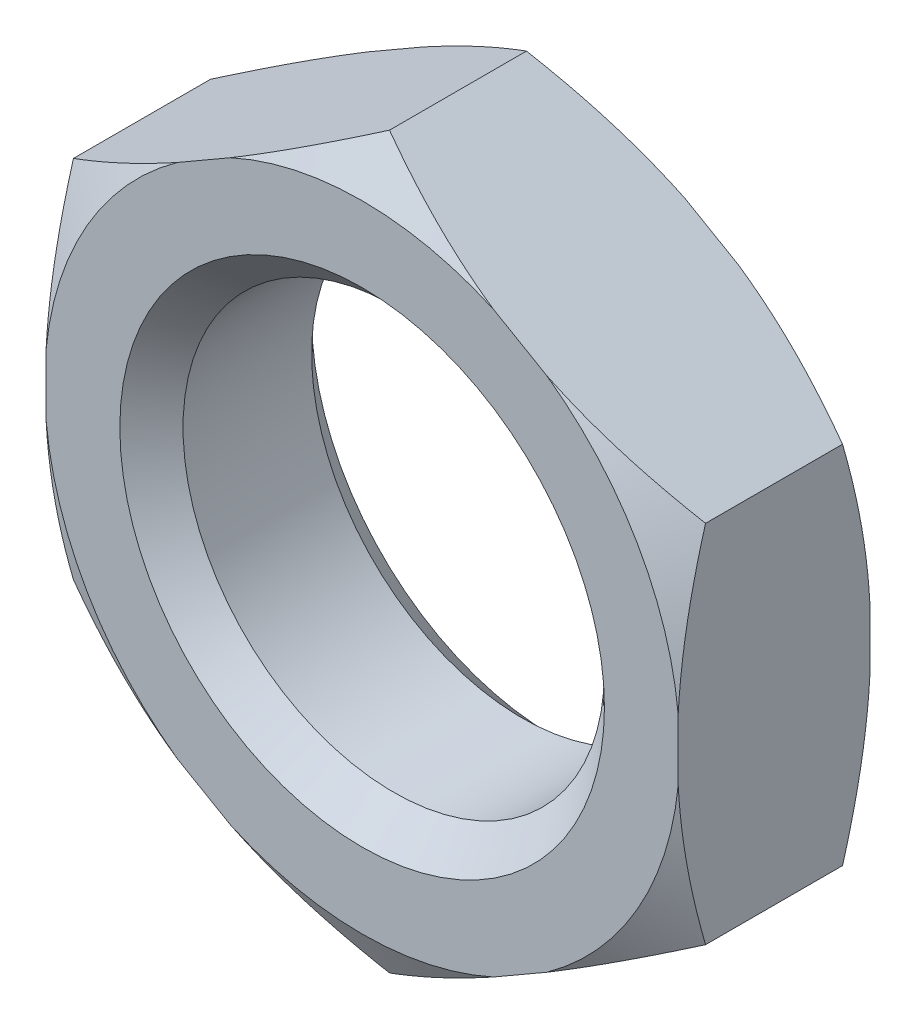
ISO-10303-21;
HEADER;
FILE_DESCRIPTION(('STEP AP214'),'2;1');
FILE_NAME('part.step','',(''),(''),'','','');
FILE_SCHEMA(('AUTOMOTIVE_DESIGN { 1 0 10303 214 1 1 1 1 }'));
ENDSEC;
DATA;
#1=APPLICATION_CONTEXT('core data for automotive mechanical design processes');
#2=APPLICATION_PROTOCOL_DEFINITION('international standard','automotive_design',2000,#1);
#3=PRODUCT_CONTEXT('',#1,'mechanical');
#4=PRODUCT('Part','Part','',(#3));
#5=PRODUCT_RELATED_PRODUCT_CATEGORY('part','',(#4));
#6=PRODUCT_DEFINITION_FORMATION('','',#4);
#7=PRODUCT_DEFINITION_CONTEXT('part definition',#1,'design');
#8=PRODUCT_DEFINITION('design','',#6,#7);
#9=PRODUCT_DEFINITION_SHAPE('','',#8);
#10=(LENGTH_UNIT() NAMED_UNIT(*) SI_UNIT(.MILLI.,.METRE.));
#11=(NAMED_UNIT(*) PLANE_ANGLE_UNIT() SI_UNIT($,.RADIAN.));
#12=(NAMED_UNIT(*) SI_UNIT($,.STERADIAN.) SOLID_ANGLE_UNIT());
#13=UNCERTAINTY_MEASURE_WITH_UNIT(LENGTH_MEASURE(1.E-05),#10,'distance_accuracy_value','');
#14=(GEOMETRIC_REPRESENTATION_CONTEXT(3) GLOBAL_UNCERTAINTY_ASSIGNED_CONTEXT((#13)) GLOBAL_UNIT_ASSIGNED_CONTEXT((#10,
#11,#12)) REPRESENTATION_CONTEXT('',''));
#15=CARTESIAN_POINT('',(0.,0.,0.));
#16=DIRECTION('',(0.,0.,1.));
#17=DIRECTION('',(1.,0.,0.));
#18=AXIS2_PLACEMENT_3D('',#15,#16,#17);
#19=CARTESIAN_POINT('',(15.,8.66025403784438,4.55));
#20=DIRECTION('',(-0.5,-0.866025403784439,0.));
#21=DIRECTION('',(0.866025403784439,-0.5,0.));
#22=AXIS2_PLACEMENT_3D('',#19,#20,#21);
#23=PLANE('',#22);
#24=CARTESIAN_POINT('',(-10.421692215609,23.3374748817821,1.50538592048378));
#25=CARTESIAN_POINT('',(-10.1860353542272,23.2014183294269,1.3781849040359));
#26=CARTESIAN_POINT('',(-9.95009304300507,23.0651969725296,1.25168946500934));
#27=CARTESIAN_POINT('',(-9.47758752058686,22.7923957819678,1.00024785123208));
#28=CARTESIAN_POINT('',(-9.24102430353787,22.6558159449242,0.875301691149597));
#29=CARTESIAN_POINT('',(-8.53027981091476,22.2454674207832,0.50296898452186));
#30=CARTESIAN_POINT('',(-8.05509856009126,21.9711213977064,0.258117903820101));
#31=CARTESIAN_POINT('',(-7.10011910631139,21.419763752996,-0.22421977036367));
#32=CARTESIAN_POINT('',(-6.62031098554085,21.1427464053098,-0.461680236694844));
#33=CARTESIAN_POINT('',(-5.65710212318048,20.5866375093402,-0.926659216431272));
#34=CARTESIAN_POINT('',(-5.17370149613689,20.3075460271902,-1.15417804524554));
#35=CARTESIAN_POINT('',(-4.19036809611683,19.7398182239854,-1.60273172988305));
#36=CARTESIAN_POINT('',(-3.69032783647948,19.4511198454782,-1.82345385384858));
#37=CARTESIAN_POINT('',(-2.68520502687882,18.8708119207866,-2.24918941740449));
#38=CARTESIAN_POINT('',(-2.18012223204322,18.5792022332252,-2.45420208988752));
#39=CARTESIAN_POINT('',(-1.16479568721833,17.9930031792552,-2.84461906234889));
#40=CARTESIAN_POINT('',(-0.654557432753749,17.6984169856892,-3.03004223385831));
#41=CARTESIAN_POINT('',(0.371909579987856,17.1057859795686,-3.37700298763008));
#42=CARTESIAN_POINT('',(0.888137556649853,16.8077416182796,-3.53854364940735));
#43=CARTESIAN_POINT('',(2.12260575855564,16.0950210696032,-3.88795790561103));
#44=CARTESIAN_POINT('',(2.84372115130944,15.67868490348,-4.0628440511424));
#45=CARTESIAN_POINT('',(3.93277266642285,15.0499207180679,-4.27310783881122));
#46=CARTESIAN_POINT('',(4.29700197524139,14.8396328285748,-4.33451650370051));
#47=CARTESIAN_POINT('',(5.02750631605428,14.4178759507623,-4.43844534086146));
#48=CARTESIAN_POINT('',(5.39378132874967,14.2064069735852,-4.48096569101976));
#49=CARTESIAN_POINT('',(6.12340863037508,13.7851564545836,-4.54551567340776));
#50=CARTESIAN_POINT('',(6.48674542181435,13.5753838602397,-4.56777767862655));
#51=CARTESIAN_POINT('',(7.21392805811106,13.1555447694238,-4.59199131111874));
#52=CARTESIAN_POINT('',(7.57777389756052,12.9454782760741,-4.59394315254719));
#53=CARTESIAN_POINT('',(8.30511523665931,12.5255475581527,-4.57747454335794));
#54=CARTESIAN_POINT('',(8.66861073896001,12.3156833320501,-4.5590542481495));
#55=CARTESIAN_POINT('',(9.39448008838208,11.8966024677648,-4.50239903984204));
#56=CARTESIAN_POINT('',(9.7568537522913,11.6873859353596,-4.46416104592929));
#57=CARTESIAN_POINT('',(10.6125702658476,11.1933377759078,-4.35143576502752));
#58=CARTESIAN_POINT('',(11.1051134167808,10.9089678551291,-4.26879174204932));
#59=CARTESIAN_POINT('',(12.0854941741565,10.3429447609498,-4.07229441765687));
#60=CARTESIAN_POINT('',(12.5733310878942,10.0612919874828,-3.95843659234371));
#61=CARTESIAN_POINT('',(13.5442363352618,9.50073958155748,-3.70380915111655));
#62=CARTESIAN_POINT('',(14.0272986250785,9.22184343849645,-3.56300912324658));
#63=CARTESIAN_POINT('',(14.9880038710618,8.66718000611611,-3.25893381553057));
#64=CARTESIAN_POINT('',(15.4656471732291,8.39141251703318,-3.09565997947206));
#65=CARTESIAN_POINT('',(16.4215113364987,7.83954408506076,-2.74845819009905));
#66=CARTESIAN_POINT('',(16.8996708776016,7.56347854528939,-2.564306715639));
#67=CARTESIAN_POINT('',(17.8509238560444,7.01427238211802,-2.18051358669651));
#68=CARTESIAN_POINT('',(18.3240204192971,6.74112995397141,-1.9808822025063));
#69=CARTESIAN_POINT('',(19.265873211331,6.1973509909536,-1.56888560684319));
#70=CARTESIAN_POINT('',(19.7346305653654,5.92671380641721,-1.35652380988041));
#71=CARTESIAN_POINT('',(20.6685220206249,5.3875313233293,-0.921259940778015));
#72=CARTESIAN_POINT('',(21.1336556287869,5.11898630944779,-0.698356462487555));
#73=CARTESIAN_POINT('',(21.9203254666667,4.66480226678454,-0.312682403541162));
#74=CARTESIAN_POINT('',(22.2426866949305,4.47868692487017,-0.152146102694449));
#75=CARTESIAN_POINT('',(22.8859893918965,4.10727593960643,0.172641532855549));
#76=CARTESIAN_POINT('',(23.2069309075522,3.92198026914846,0.336892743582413));
#77=CARTESIAN_POINT('',(23.8441453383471,3.55408434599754,0.66691204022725));
#78=CARTESIAN_POINT('',(24.160431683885,3.37147633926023,0.832645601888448));
#79=CARTESIAN_POINT('',(24.7918786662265,3.00691025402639,1.16696568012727));
#80=CARTESIAN_POINT('',(25.1070392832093,2.82495218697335,1.33555224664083));
#81=CARTESIAN_POINT('',(25.421692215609,2.64328723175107,1.50538592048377));
#82=B_SPLINE_CURVE_WITH_KNOTS('',3,(#24,#25,#26,#27,#28,#29,#30,#31,#32,#33,#34,#35,#36,#37,#38,
#39,#40,#41,#42,#43,#44,#45,#46,#47,#48,#49,#50,#51,#52,#53,#54,#55,#56,#57,#58,#59,#60,#61,#62,
#63,#64,#65,#66,#67,#68,#69,#70,#71,#72,#73,#74,#75,#76,#77,#78,#79,#80,#81),.UNSPECIFIED.,.F.,
.F.,(4,2,2,2,2,2,2,2,2,2,2,2,2,2,2,2,2,2,2,2,2,2,2,2,2,2,2,2,4),(0.,0.901125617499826,
1.80225976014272,3.60473793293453,5.41299483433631,7.22119432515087,9.07544754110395,
10.9297912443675,12.7823319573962,14.6346335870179,17.1843859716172,18.4591402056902,
19.7338824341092,20.9938113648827,22.2537270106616,23.5136330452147,24.77373500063,
26.4968317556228,28.2201783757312,29.9454818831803,31.6706746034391,33.416485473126,
35.1611478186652,36.9053442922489,38.6497740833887,39.8658744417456,41.0819342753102,
42.2851062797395,43.488299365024),.UNSPECIFIED.);
#83=CARTESIAN_POINT('',(0.,17.3205080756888,-3.25096189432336));
#84=VERTEX_POINT('',#83);
#85=CARTESIAN_POINT('',(6.23898443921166,13.71842873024,-4.55));
#86=VERTEX_POINT('',#85);
#87=EDGE_CURVE('E177',#84,#86,#82,.T.);
#88=ORIENTED_EDGE('',*,*,#87,.F.);
#89=DIRECTION('',(0.,0.,-1.));
#90=VECTOR('',#89,1.);
#91=CARTESIAN_POINT('',(0.,17.3205080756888,4.55));
#92=LINE('',#91,#90);
#93=CARTESIAN_POINT('',(0.,17.3205080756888,3.25096189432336));
#94=VERTEX_POINT('',#93);
#95=EDGE_CURVE('E223',#94,#84,#92,.T.);
#96=ORIENTED_EDGE('',*,*,#95,.F.);
#97=CARTESIAN_POINT('',(25.421692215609,2.64328723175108,-1.50538592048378));
#98=CARTESIAN_POINT('',(25.1860353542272,2.77934378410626,-1.3781849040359));
#99=CARTESIAN_POINT('',(24.9500930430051,2.91556514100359,-1.25168946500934));
#100=CARTESIAN_POINT('',(24.4775875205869,3.18836633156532,-1.00024785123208));
#101=CARTESIAN_POINT('',(24.2410243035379,3.32494616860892,-0.875301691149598));
#102=CARTESIAN_POINT('',(23.5302798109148,3.73529469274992,-0.502968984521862));
#103=CARTESIAN_POINT('',(23.0550985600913,4.00964071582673,-0.258117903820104));
#104=CARTESIAN_POINT('',(22.1001191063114,4.5609983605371,0.224219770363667));
#105=CARTESIAN_POINT('',(21.6203109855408,4.83801570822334,0.461680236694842));
#106=CARTESIAN_POINT('',(20.6571021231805,5.39412460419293,0.92665921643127));
#107=CARTESIAN_POINT('',(20.1737014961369,5.67321608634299,1.15417804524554));
#108=CARTESIAN_POINT('',(19.1903680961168,6.24094388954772,1.60273172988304));
#109=CARTESIAN_POINT('',(18.6903278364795,6.52964226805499,1.82345385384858));
#110=CARTESIAN_POINT('',(17.6852050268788,7.10995019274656,2.24918941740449));
#111=CARTESIAN_POINT('',(17.1801222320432,7.40155988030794,2.45420208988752));
#112=CARTESIAN_POINT('',(16.1647956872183,7.98775893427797,2.84461906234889));
#113=CARTESIAN_POINT('',(15.6545574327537,8.28234512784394,3.03004223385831));
#114=CARTESIAN_POINT('',(14.6280904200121,8.87497613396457,3.37700298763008));
#115=CARTESIAN_POINT('',(14.1118624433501,9.17302049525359,3.53854364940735));
#116=CARTESIAN_POINT('',(12.8773942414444,9.88574104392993,3.88795790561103));
#117=CARTESIAN_POINT('',(12.1562788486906,10.3020772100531,4.06284405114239));
#118=CARTESIAN_POINT('',(11.0672273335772,10.9308413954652,4.27310783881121));
#119=CARTESIAN_POINT('',(10.7029980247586,11.1411292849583,4.33451650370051));
#120=CARTESIAN_POINT('',(9.97249368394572,11.5628861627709,4.43844534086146));
#121=CARTESIAN_POINT('',(9.60621867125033,11.774355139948,4.48096569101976));
#122=CARTESIAN_POINT('',(8.87659136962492,12.1956056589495,4.54551567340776));
#123=CARTESIAN_POINT('',(8.51325457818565,12.4053782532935,4.56777767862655));
#124=CARTESIAN_POINT('',(7.78607194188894,12.8252173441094,4.59199131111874));
#125=CARTESIAN_POINT('',(7.42222610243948,13.0352838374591,4.59394315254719));
#126=CARTESIAN_POINT('',(6.69488476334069,13.4552145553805,4.57747454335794));
#127=CARTESIAN_POINT('',(6.33138926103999,13.665078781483,4.5590542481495));
#128=CARTESIAN_POINT('',(5.60551991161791,14.0841596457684,4.50239903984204));
#129=CARTESIAN_POINT('',(5.24314624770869,14.2933761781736,4.46416104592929));
#130=CARTESIAN_POINT('',(4.38742973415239,14.7874243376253,4.35143576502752));
#131=CARTESIAN_POINT('',(3.89488658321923,15.0717942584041,4.26879174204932));
#132=CARTESIAN_POINT('',(2.91450582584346,15.6378173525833,4.07229441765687));
#133=CARTESIAN_POINT('',(2.42666891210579,15.9194701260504,3.95843659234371));
#134=CARTESIAN_POINT('',(1.45576366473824,16.4800225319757,3.70380915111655));
#135=CARTESIAN_POINT('',(0.972701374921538,16.7589186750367,3.56300912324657));
#136=CARTESIAN_POINT('',(0.0119961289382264,17.313582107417,3.25893381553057));
#137=CARTESIAN_POINT('',(-0.465647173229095,17.5893495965,3.09565997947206));
#138=CARTESIAN_POINT('',(-1.4215113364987,18.1412180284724,2.74845819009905));
#139=CARTESIAN_POINT('',(-1.89967087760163,18.4172835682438,2.564306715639));
#140=CARTESIAN_POINT('',(-2.85092385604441,18.9664897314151,2.18051358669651));
#141=CARTESIAN_POINT('',(-3.32402041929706,19.2396321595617,1.9808822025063));
#142=CARTESIAN_POINT('',(-4.26587321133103,19.7834111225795,1.5688856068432));
#143=CARTESIAN_POINT('',(-4.73463056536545,20.0540483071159,1.35652380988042));
#144=CARTESIAN_POINT('',(-5.66852202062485,20.5932307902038,0.921259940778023));
#145=CARTESIAN_POINT('',(-6.13365562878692,20.8617758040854,0.698356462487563));
#146=CARTESIAN_POINT('',(-6.9203254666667,21.3159598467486,0.312682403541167));
#147=CARTESIAN_POINT('',(-7.24268669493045,21.502075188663,0.152146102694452));
#148=CARTESIAN_POINT('',(-7.88598939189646,21.8734861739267,-0.172641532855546));
#149=CARTESIAN_POINT('',(-8.2069309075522,22.0587818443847,-0.33689274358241));
#150=CARTESIAN_POINT('',(-8.84414533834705,22.4266777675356,-0.666912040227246));
#151=CARTESIAN_POINT('',(-9.16043168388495,22.6092857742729,-0.832645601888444));
#152=CARTESIAN_POINT('',(-9.79187866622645,22.9738518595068,-1.16696568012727));
#153=CARTESIAN_POINT('',(-10.1070392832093,23.1558099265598,-1.33555224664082));
#154=CARTESIAN_POINT('',(-10.4216922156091,23.3374748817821,-1.50538592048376));
#155=B_SPLINE_CURVE_WITH_KNOTS('',3,(#97,#98,#99,#100,#101,#102,#103,#104,#105,#106,#107,#108,
#109,#110,#111,#112,#113,#114,#115,#116,#117,#118,#119,#120,#121,#122,#123,#124,#125,#126,#127,
#128,#129,#130,#131,#132,#133,#134,#135,#136,#137,#138,#139,#140,#141,#142,#143,#144,#145,#146,
#147,#148,#149,#150,#151,#152,#153,#154),.UNSPECIFIED.,.F.,.F.,(4,2,2,2,2,2,2,2,2,2,2,2,2,2,2,2,
2,2,2,2,2,2,2,2,2,2,2,2,4),(0.,0.901125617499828,1.80225976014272,3.60473793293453,
5.41299483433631,7.22119432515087,9.07544754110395,10.9297912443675,12.7823319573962,
14.6346335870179,17.1843859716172,18.4591402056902,19.7338824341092,20.9938113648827,
22.2537270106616,23.5136330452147,24.77373500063,26.4968317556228,28.2201783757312,
29.9454818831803,31.6706746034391,33.416485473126,35.1611478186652,36.9053442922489,
38.6497740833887,39.8658744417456,41.0819342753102,42.2851062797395,43.488299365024),.UNSPECIFIED.);
#156=CARTESIAN_POINT('',(6.23898443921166,13.71842873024,4.55));
#157=VERTEX_POINT('',#156);
#158=EDGE_CURVE('E374',#157,#94,#155,.T.);
#159=ORIENTED_EDGE('',*,*,#158,.F.);
#160=DIRECTION('',(-0.866025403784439,0.5,0.));
#161=VECTOR('',#160,1.);
#162=CARTESIAN_POINT('',(15.,8.66025403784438,4.55));
#163=LINE('',#162,#161);
#164=CARTESIAN_POINT('',(8.76101556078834,12.2623333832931,4.55));
#165=VERTEX_POINT('',#164);
#166=EDGE_CURVE('E353',#165,#157,#163,.T.);
#167=ORIENTED_EDGE('',*,*,#166,.F.);
#168=CARTESIAN_POINT('',(15.,8.66025403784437,3.25096189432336));
#169=VERTEX_POINT('',#168);
#170=EDGE_CURVE('E194',#169,#165,#155,.T.);
#171=ORIENTED_EDGE('',*,*,#170,.F.);
#172=DIRECTION('',(0.,0.,-1.));
#173=VECTOR('',#172,1.);
#174=CARTESIAN_POINT('',(15.,8.66025403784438,4.55));
#175=LINE('',#174,#173);
#176=CARTESIAN_POINT('',(15.,8.66025403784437,-3.25096189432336));
#177=VERTEX_POINT('',#176);
#178=EDGE_CURVE('E183',#169,#177,#175,.T.);
#179=ORIENTED_EDGE('',*,*,#178,.T.);
#180=CARTESIAN_POINT('',(8.76101556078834,12.2623333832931,-4.55));
#181=VERTEX_POINT('',#180);
#182=EDGE_CURVE('E164',#181,#177,#82,.T.);
#183=ORIENTED_EDGE('',*,*,#182,.F.);
#184=DIRECTION('',(-0.866025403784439,0.5,0.));
#185=VECTOR('',#184,1.);
#186=CARTESIAN_POINT('',(15.,8.66025403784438,-4.55));
#187=LINE('',#186,#185);
#188=EDGE_CURVE('E266',#181,#86,#187,.T.);
#189=ORIENTED_EDGE('',*,*,#188,.T.);
#190=EDGE_LOOP('',(#88,#96,#159,#167,#171,#179,#183,#189));
#191=FACE_BOUND('',#190,.T.);
#192=ADVANCED_FACE('F39',(#191),#23,.F.);
#193=CARTESIAN_POINT('',(0.,17.3205080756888,4.55));
#194=DIRECTION('',(0.5,-0.866025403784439,0.));
#195=DIRECTION('',(0.866025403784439,0.5,0.));
#196=AXIS2_PLACEMENT_3D('',#193,#194,#195);
#197=PLANE('',#196);
#198=CARTESIAN_POINT('',(-25.421692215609,2.64328723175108,1.50538592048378));
#199=CARTESIAN_POINT('',(-25.1860353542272,2.77934378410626,1.37818490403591));
#200=CARTESIAN_POINT('',(-24.9500930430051,2.91556514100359,1.25168946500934));
#201=CARTESIAN_POINT('',(-24.4775875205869,3.18836633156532,1.00024785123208));
#202=CARTESIAN_POINT('',(-24.2410243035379,3.32494616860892,0.875301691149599));
#203=CARTESIAN_POINT('',(-23.5302798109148,3.73529469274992,0.502968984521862));
#204=CARTESIAN_POINT('',(-23.0550985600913,4.00964071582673,0.258117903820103));
#205=CARTESIAN_POINT('',(-22.1001191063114,4.5609983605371,-0.224219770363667));
#206=CARTESIAN_POINT('',(-21.6203109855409,4.83801570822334,-0.461680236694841));
#207=CARTESIAN_POINT('',(-20.6571021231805,5.39412460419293,-0.926659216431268));
#208=CARTESIAN_POINT('',(-20.1737014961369,5.67321608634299,-1.15417804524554));
#209=CARTESIAN_POINT('',(-19.1903680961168,6.24094388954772,-1.60273172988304));
#210=CARTESIAN_POINT('',(-18.6903278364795,6.52964226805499,-1.82345385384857));
#211=CARTESIAN_POINT('',(-17.6852050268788,7.10995019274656,-2.24918941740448));
#212=CARTESIAN_POINT('',(-17.1801222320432,7.40155988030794,-2.45420208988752));
#213=CARTESIAN_POINT('',(-16.1647956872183,7.98775893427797,-2.84461906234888));
#214=CARTESIAN_POINT('',(-15.6545574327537,8.28234512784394,-3.0300422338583));
#215=CARTESIAN_POINT('',(-14.6280904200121,8.87497613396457,-3.37700298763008));
#216=CARTESIAN_POINT('',(-14.1118624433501,9.17302049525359,-3.53854364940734));
#217=CARTESIAN_POINT('',(-12.8773942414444,9.88574104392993,-3.88795790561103));
#218=CARTESIAN_POINT('',(-12.1562788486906,10.3020772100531,-4.0628440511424));
#219=CARTESIAN_POINT('',(-11.0672273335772,10.9308413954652,-4.27310783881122));
#220=CARTESIAN_POINT('',(-10.7029980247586,11.1411292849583,-4.33451650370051));
#221=CARTESIAN_POINT('',(-9.97249368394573,11.5628861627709,-4.43844534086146));
#222=CARTESIAN_POINT('',(-9.60621867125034,11.774355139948,-4.48096569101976));
#223=CARTESIAN_POINT('',(-8.87659136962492,12.1956056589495,-4.54551567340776));
#224=CARTESIAN_POINT('',(-8.51325457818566,12.4053782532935,-4.56777767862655));
#225=CARTESIAN_POINT('',(-7.78607194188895,12.8252173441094,-4.59199131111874));
#226=CARTESIAN_POINT('',(-7.42222610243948,13.0352838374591,-4.59394315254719));
#227=CARTESIAN_POINT('',(-6.6948847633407,13.4552145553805,-4.57747454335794));
#228=CARTESIAN_POINT('',(-6.33138926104,13.665078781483,-4.5590542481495));
#229=CARTESIAN_POINT('',(-5.60551991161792,14.0841596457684,-4.50239903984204));
#230=CARTESIAN_POINT('',(-5.2431462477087,14.2933761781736,-4.46416104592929));
#231=CARTESIAN_POINT('',(-4.38742973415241,14.7874243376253,-4.35143576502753));
#232=CARTESIAN_POINT('',(-3.89488658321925,15.0717942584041,-4.26879174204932));
#233=CARTESIAN_POINT('',(-2.91450582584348,15.6378173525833,-4.07229441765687));
#234=CARTESIAN_POINT('',(-2.42666891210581,15.9194701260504,-3.95843659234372));
#235=CARTESIAN_POINT('',(-1.45576366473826,16.4800225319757,-3.70380915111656));
#236=CARTESIAN_POINT('',(-0.972701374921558,16.7589186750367,-3.56300912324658));
#237=CARTESIAN_POINT('',(-0.0119961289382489,17.313582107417,-3.25893381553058));
#238=CARTESIAN_POINT('',(0.46564717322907,17.5893495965,-3.09565997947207));
#239=CARTESIAN_POINT('',(1.42151133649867,18.1412180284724,-2.74845819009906));
#240=CARTESIAN_POINT('',(1.8996708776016,18.4172835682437,-2.56430671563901));
#241=CARTESIAN_POINT('',(2.85092385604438,18.9664897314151,-2.18051358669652));
#242=CARTESIAN_POINT('',(3.32402041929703,19.2396321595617,-1.98088220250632));
#243=CARTESIAN_POINT('',(4.265873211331,19.7834111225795,-1.56888560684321));
#244=CARTESIAN_POINT('',(4.73463056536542,20.0540483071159,-1.35652380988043));
#245=CARTESIAN_POINT('',(5.66852202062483,20.5932307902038,-0.921259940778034));
#246=CARTESIAN_POINT('',(6.1336556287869,20.8617758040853,-0.698356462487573));
#247=CARTESIAN_POINT('',(6.92032546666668,21.3159598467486,-0.312682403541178));
#248=CARTESIAN_POINT('',(7.24268669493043,21.502075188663,-0.152146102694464));
#249=CARTESIAN_POINT('',(7.88598939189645,21.8734861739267,0.172641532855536));
#250=CARTESIAN_POINT('',(8.20693090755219,22.0587818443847,0.336892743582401));
#251=CARTESIAN_POINT('',(8.84414533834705,22.4266777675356,0.666912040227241));
#252=CARTESIAN_POINT('',(9.16043168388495,22.6092857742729,0.83264560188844));
#253=CARTESIAN_POINT('',(9.79187866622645,22.9738518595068,1.16696568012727));
#254=CARTESIAN_POINT('',(10.1070392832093,23.1558099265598,1.33555224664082));
#255=CARTESIAN_POINT('',(10.4216922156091,23.3374748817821,1.50538592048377));
#256=B_SPLINE_CURVE_WITH_KNOTS('',3,(#198,#199,#200,#201,#202,#203,#204,#205,#206,#207,#208,
#209,#210,#211,#212,#213,#214,#215,#216,#217,#218,#219,#220,#221,#222,#223,#224,#225,#226,#227,
#228,#229,#230,#231,#232,#233,#234,#235,#236,#237,#238,#239,#240,#241,#242,#243,#244,#245,#246,
#247,#248,#249,#250,#251,#252,#253,#254,#255),.UNSPECIFIED.,.F.,.F.,(4,2,2,2,2,2,2,2,2,2,2,2,2,
2,2,2,2,2,2,2,2,2,2,2,2,2,2,2,4),(0.,0.901125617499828,1.80225976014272,3.60473793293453,
5.41299483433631,7.22119432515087,9.07544754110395,10.9297912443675,12.7823319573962,
14.6346335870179,17.1843859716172,18.4591402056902,19.7338824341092,20.9938113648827,
22.2537270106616,23.5136330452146,24.77373500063,26.4968317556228,28.2201783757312,
29.9454818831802,31.670674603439,33.4164854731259,35.1611478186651,36.9053442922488,
38.6497740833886,39.8658744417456,41.0819342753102,42.2851062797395,43.488299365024),.UNSPECIFIED.);
#257=CARTESIAN_POINT('',(-15.,8.66025403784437,-3.25096189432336));
#258=VERTEX_POINT('',#257);
#259=CARTESIAN_POINT('',(-8.76101556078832,12.2623333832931,-4.55));
#260=VERTEX_POINT('',#259);
#261=EDGE_CURVE('E55',#258,#260,#256,.T.);
#262=ORIENTED_EDGE('',*,*,#261,.F.);
#263=DIRECTION('',(0.,0.,-1.));
#264=VECTOR('',#263,1.);
#265=CARTESIAN_POINT('',(-15.,8.66025403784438,4.55));
#266=LINE('',#265,#264);
#267=CARTESIAN_POINT('',(-15.,8.66025403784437,3.25096189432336));
#268=VERTEX_POINT('',#267);
#269=EDGE_CURVE('E219',#268,#258,#266,.T.);
#270=ORIENTED_EDGE('',*,*,#269,.F.);
#271=CARTESIAN_POINT('',(10.421692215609,23.3374748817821,-1.50538592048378));
#272=CARTESIAN_POINT('',(10.1860353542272,23.2014183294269,-1.3781849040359));
#273=CARTESIAN_POINT('',(9.95009304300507,23.0651969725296,-1.25168946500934));
#274=CARTESIAN_POINT('',(9.47758752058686,22.7923957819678,-1.00024785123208));
#275=CARTESIAN_POINT('',(9.24102430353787,22.6558159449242,-0.875301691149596));
#276=CARTESIAN_POINT('',(8.53027981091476,22.2454674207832,-0.50296898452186));
#277=CARTESIAN_POINT('',(8.05509856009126,21.9711213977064,-0.258117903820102));
#278=CARTESIAN_POINT('',(7.10011910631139,21.419763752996,0.224219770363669));
#279=CARTESIAN_POINT('',(6.62031098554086,21.1427464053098,0.461680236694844));
#280=CARTESIAN_POINT('',(5.65710212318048,20.5866375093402,0.926659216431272));
#281=CARTESIAN_POINT('',(5.17370149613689,20.3075460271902,1.15417804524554));
#282=CARTESIAN_POINT('',(4.19036809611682,19.7398182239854,1.60273172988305));
#283=CARTESIAN_POINT('',(3.69032783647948,19.4511198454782,1.82345385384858));
#284=CARTESIAN_POINT('',(2.68520502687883,18.8708119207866,2.24918941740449));
#285=CARTESIAN_POINT('',(2.18012223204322,18.5792022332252,2.45420208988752));
#286=CARTESIAN_POINT('',(1.16479568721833,17.9930031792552,2.84461906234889));
#287=CARTESIAN_POINT('',(0.65455743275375,17.6984169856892,3.03004223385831));
#288=CARTESIAN_POINT('',(-0.371909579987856,17.1057859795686,3.37700298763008));
#289=CARTESIAN_POINT('',(-0.888137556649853,16.8077416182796,3.53854364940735));
#290=CARTESIAN_POINT('',(-2.12260575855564,16.0950210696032,3.88795790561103));
#291=CARTESIAN_POINT('',(-2.84372115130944,15.67868490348,4.0628440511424));
#292=CARTESIAN_POINT('',(-3.93277266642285,15.0499207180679,4.27310783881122));
#293=CARTESIAN_POINT('',(-4.29700197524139,14.8396328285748,4.33451650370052));
#294=CARTESIAN_POINT('',(-5.02750631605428,14.4178759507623,4.43844534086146));
#295=CARTESIAN_POINT('',(-5.39378132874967,14.2064069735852,4.48096569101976));
#296=CARTESIAN_POINT('',(-6.12340863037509,13.7851564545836,4.54551567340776));
#297=CARTESIAN_POINT('',(-6.48674542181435,13.5753838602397,4.56777767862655));
#298=CARTESIAN_POINT('',(-7.21392805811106,13.1555447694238,4.59199131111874));
#299=CARTESIAN_POINT('',(-7.57777389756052,12.9454782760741,4.59394315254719));
#300=CARTESIAN_POINT('',(-8.30511523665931,12.5255475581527,4.57747454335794));
#301=CARTESIAN_POINT('',(-8.66861073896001,12.3156833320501,4.5590542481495));
#302=CARTESIAN_POINT('',(-9.39448008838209,11.8966024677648,4.50239903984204));
#303=CARTESIAN_POINT('',(-9.75685375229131,11.6873859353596,4.46416104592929));
#304=CARTESIAN_POINT('',(-10.6125702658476,11.1933377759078,4.35143576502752));
#305=CARTESIAN_POINT('',(-11.1051134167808,10.9089678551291,4.26879174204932));
#306=CARTESIAN_POINT('',(-12.0854941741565,10.3429447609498,4.07229441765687));
#307=CARTESIAN_POINT('',(-12.5733310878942,10.0612919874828,3.95843659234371));
#308=CARTESIAN_POINT('',(-13.5442363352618,9.50073958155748,3.70380915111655));
#309=CARTESIAN_POINT('',(-14.0272986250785,9.22184343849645,3.56300912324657));
#310=CARTESIAN_POINT('',(-14.9880038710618,8.6671800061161,3.25893381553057));
#311=CARTESIAN_POINT('',(-15.4656471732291,8.39141251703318,3.09565997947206));
#312=CARTESIAN_POINT('',(-16.4215113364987,7.83954408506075,2.74845819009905));
#313=CARTESIAN_POINT('',(-16.8996708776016,7.56347854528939,2.56430671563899));
#314=CARTESIAN_POINT('',(-17.8509238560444,7.01427238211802,2.1805135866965));
#315=CARTESIAN_POINT('',(-18.3240204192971,6.74112995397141,1.9808822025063));
#316=CARTESIAN_POINT('',(-19.265873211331,6.19735099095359,1.56888560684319));
#317=CARTESIAN_POINT('',(-19.7346305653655,5.92671380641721,1.35652380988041));
#318=CARTESIAN_POINT('',(-20.6685220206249,5.3875313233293,0.921259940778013));
#319=CARTESIAN_POINT('',(-21.1336556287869,5.11898630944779,0.698356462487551));
#320=CARTESIAN_POINT('',(-21.9203254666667,4.66480226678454,0.312682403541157));
#321=CARTESIAN_POINT('',(-22.2426866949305,4.47868692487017,0.152146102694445));
#322=CARTESIAN_POINT('',(-22.8859893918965,4.10727593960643,-0.172641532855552));
#323=CARTESIAN_POINT('',(-23.2069309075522,3.92198026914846,-0.336892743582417));
#324=CARTESIAN_POINT('',(-23.8441453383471,3.55408434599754,-0.666912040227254));
#325=CARTESIAN_POINT('',(-24.160431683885,3.37147633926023,-0.83264560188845));
#326=CARTESIAN_POINT('',(-24.7918786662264,3.00691025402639,-1.16696568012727));
#327=CARTESIAN_POINT('',(-25.1070392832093,2.82495218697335,-1.33555224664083));
#328=CARTESIAN_POINT('',(-25.421692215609,2.64328723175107,-1.50538592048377));
#329=B_SPLINE_CURVE_WITH_KNOTS('',3,(#271,#272,#273,#274,#275,#276,#277,#278,#279,#280,#281,
#282,#283,#284,#285,#286,#287,#288,#289,#290,#291,#292,#293,#294,#295,#296,#297,#298,#299,#300,
#301,#302,#303,#304,#305,#306,#307,#308,#309,#310,#311,#312,#313,#314,#315,#316,#317,#318,#319,
#320,#321,#322,#323,#324,#325,#326,#327,#328),.UNSPECIFIED.,.F.,.F.,(4,2,2,2,2,2,2,2,2,2,2,2,2,
2,2,2,2,2,2,2,2,2,2,2,2,2,2,2,4),(0.,0.901125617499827,1.80225976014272,3.60473793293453,
5.41299483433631,7.22119432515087,9.07544754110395,10.9297912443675,12.7823319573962,
14.6346335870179,17.1843859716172,18.4591402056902,19.7338824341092,20.9938113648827,
22.2537270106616,23.5136330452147,24.77373500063,26.4968317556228,28.2201783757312,
29.9454818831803,31.6706746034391,33.416485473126,35.1611478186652,36.9053442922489,
38.6497740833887,39.8658744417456,41.0819342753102,42.2851062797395,43.488299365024),.UNSPECIFIED.);
#330=CARTESIAN_POINT('',(-8.76101556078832,12.2623333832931,4.55));
#331=VERTEX_POINT('',#330);
#332=EDGE_CURVE('E346',#331,#268,#329,.T.);
#333=ORIENTED_EDGE('',*,*,#332,.F.);
#334=DIRECTION('',(-0.866025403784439,-0.5,0.));
#335=VECTOR('',#334,1.);
#336=CARTESIAN_POINT('',(0.,17.3205080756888,4.55));
#337=LINE('',#336,#335);
#338=CARTESIAN_POINT('',(-6.23898443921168,13.71842873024,4.55));
#339=VERTEX_POINT('',#338);
#340=EDGE_CURVE('E357',#339,#331,#337,.T.);
#341=ORIENTED_EDGE('',*,*,#340,.F.);
#342=EDGE_CURVE('E352',#94,#339,#329,.T.);
#343=ORIENTED_EDGE('',*,*,#342,.F.);
#344=ORIENTED_EDGE('',*,*,#95,.T.);
#345=CARTESIAN_POINT('',(-6.23898443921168,13.71842873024,-4.55));
#346=VERTEX_POINT('',#345);
#347=EDGE_CURVE('E398',#346,#84,#256,.T.);
#348=ORIENTED_EDGE('',*,*,#347,.F.);
#349=DIRECTION('',(-0.866025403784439,-0.5,0.));
#350=VECTOR('',#349,1.);
#351=CARTESIAN_POINT('',(0.,17.3205080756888,-4.55));
#352=LINE('',#351,#350);
#353=EDGE_CURVE('E373',#346,#260,#352,.T.);
#354=ORIENTED_EDGE('',*,*,#353,.T.);
#355=EDGE_LOOP('',(#262,#270,#333,#341,#343,#344,#348,#354));
#356=FACE_BOUND('',#355,.T.);
#357=ADVANCED_FACE('F326',(#356),#197,.F.);
#358=CARTESIAN_POINT('',(-15.,8.66025403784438,4.55));
#359=DIRECTION('',(1.,0.,0.));
#360=DIRECTION('',(0.,0.,-1.));
#361=AXIS2_PLACEMENT_3D('',#358,#359,#360);
#362=PLANE('',#361);
#363=CARTESIAN_POINT('',(-15.,-19.0819462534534,0.762373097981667));
#364=CARTESIAN_POINT('',(-15.,-18.8109804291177,0.639384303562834));
#365=CARTESIAN_POINT('',(-15.,-18.5396403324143,0.517220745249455));
#366=CARTESIAN_POINT('',(-15.,-17.9961450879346,0.274710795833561));
#367=CARTESIAN_POINT('',(-15.,-17.7239899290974,0.154364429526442));
#368=CARTESIAN_POINT('',(-15.,-16.9061217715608,-0.203733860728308));
#369=CARTESIAN_POINT('',(-15.,-16.359096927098,-0.438503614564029));
#370=CARTESIAN_POINT('',(-15.,-15.258717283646,-0.899383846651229));
#371=CARTESIAN_POINT('',(-15.,-14.7053455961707,-1.12545410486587));
#372=CARTESIAN_POINT('',(-15.,-13.5939263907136,-1.56576624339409));
#373=CARTESIAN_POINT('',(-15.,-13.0358790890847,-1.78000866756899));
#374=CARTESIAN_POINT('',(-15.,-11.9169150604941,-2.19310443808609));
#375=CARTESIAN_POINT('',(-15.,-11.3560221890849,-2.39202208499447));
#376=CARTESIAN_POINT('',(-15.,-10.2282423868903,-2.77229423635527));
#377=CARTESIAN_POINT('',(-15.,-9.66135516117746,-2.95364787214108));
#378=CARTESIAN_POINT('',(-15.,-8.52185364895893,-3.29464182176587));
#379=CARTESIAN_POINT('',(-15.,-7.94924789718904,-3.45431044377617));
#380=CARTESIAN_POINT('',(-15.,-6.7974095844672,-3.74766596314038));
#381=CARTESIAN_POINT('',(-15.,-6.21817796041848,-3.88135648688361));
#382=CARTESIAN_POINT('',(-15.,-5.21830810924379,-4.0843920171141));
#383=CARTESIAN_POINT('',(-15.,-4.79919250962,-4.16123869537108));
#384=CARTESIAN_POINT('',(-15.,-3.95809524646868,-4.29731060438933));
#385=CARTESIAN_POINT('',(-15.,-3.53611367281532,-4.35653638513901));
#386=CARTESIAN_POINT('',(-15.,-2.68998995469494,-4.45580133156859));
#387=CARTESIAN_POINT('',(-15.,-2.26584838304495,-4.49584534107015));
#388=CARTESIAN_POINT('',(-15.,-1.4161227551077,-4.55560652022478));
#389=CARTESIAN_POINT('',(-15.,-0.990538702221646,-4.57532373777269));
#390=CARTESIAN_POINT('',(-15.,-0.139131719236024,-4.59381651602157));
#391=CARTESIAN_POINT('',(-15.,0.286690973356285,-4.59260290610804));
#392=CARTESIAN_POINT('',(-15.,1.1377565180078,-4.569299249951));
#393=CARTESIAN_POINT('',(-15.,1.56299937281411,-4.54720930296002));
#394=CARTESIAN_POINT('',(-15.,2.41198472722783,-4.48282755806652));
#395=CARTESIAN_POINT('',(-15.,2.83572706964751,-4.44053370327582));
#396=CARTESIAN_POINT('',(-15.,3.68087340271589,-4.33696172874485));
#397=CARTESIAN_POINT('',(-15.,4.10227729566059,-4.2756828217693));
#398=CARTESIAN_POINT('',(-15.,5.15251159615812,-4.1006543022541));
#399=CARTESIAN_POINT('',(-15.,5.77953250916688,-3.97599616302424));
#400=CARTESIAN_POINT('',(-15.,7.02605024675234,-3.69348266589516));
#401=CARTESIAN_POINT('',(-15.,7.64554536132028,-3.53561990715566));
#402=CARTESIAN_POINT('',(-15.,8.87824229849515,-3.19228425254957));
#403=CARTESIAN_POINT('',(-15.,9.49142713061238,-3.00675094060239));
#404=CARTESIAN_POINT('',(-15.,10.7105635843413,-2.61359860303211));
#405=CARTESIAN_POINT('',(-15.,11.3165157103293,-2.40598112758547));
#406=CARTESIAN_POINT('',(-15.,12.5289307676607,-1.97050263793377));
#407=CARTESIAN_POINT('',(-15.,13.1353195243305,-1.74243638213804));
#408=CARTESIAN_POINT('',(-15.,14.3424224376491,-1.27171538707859));
#409=CARTESIAN_POINT('',(-15.,14.9431362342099,-1.02905972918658));
#410=CARTESIAN_POINT('',(-15.,16.1359402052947,-0.533544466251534));
#411=CARTESIAN_POINT('',(-15.,16.728060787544,-0.28075782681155));
#412=CARTESIAN_POINT('',(-15.,17.6130673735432,0.105471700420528));
#413=CARTESIAN_POINT('',(-15.,17.9075066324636,0.235374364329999));
#414=CARTESIAN_POINT('',(-15.,18.4954251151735,0.49732099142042));
#415=CARTESIAN_POINT('',(-15.,18.7889043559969,0.629364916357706));
#416=CARTESIAN_POINT('',(-15.,19.0819462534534,0.762373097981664));
#417=B_SPLINE_CURVE_WITH_KNOTS('',3,(#363,#364,#365,#366,#367,#368,#369,#370,#371,#372,#373,
#374,#375,#376,#377,#378,#379,#380,#381,#382,#383,#384,#385,#386,#387,#388,#389,#390,#391,#392,
#393,#394,#395,#396,#397,#398,#399,#400,#401,#402,#403,#404,#405,#406,#407,#408,#409,#410,#411,
#412,#413,#414,#415,#416),.UNSPECIFIED.,.F.,.F.,(4,2,2,2,2,2,2,2,2,2,2,2,2,2,2,2,2,2,2,2,2,2,2,
2,2,2,4),(0.,0.8927115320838,1.78543523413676,3.57118203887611,5.36438019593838,
7.15749583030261,8.94262389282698,10.727840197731,12.5107031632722,14.2933170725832,
15.5712988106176,16.8492406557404,18.1268596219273,19.4044755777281,20.6814305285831,
21.9583794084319,23.2354583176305,24.512590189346,26.4293116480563,28.3464607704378,
30.2678588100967,32.189122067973,34.1324672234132,36.0759348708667,38.0072981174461,
38.9727563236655,39.938197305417),.UNSPECIFIED.);
#418=CARTESIAN_POINT('',(-15.,-8.66025403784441,-3.25096189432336));
#419=VERTEX_POINT('',#418);
#420=CARTESIAN_POINT('',(-15.,-1.45609534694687,-4.55));
#421=VERTEX_POINT('',#420);
#422=EDGE_CURVE('E63',#419,#421,#417,.T.);
#423=ORIENTED_EDGE('',*,*,#422,.F.);
#424=DIRECTION('',(0.,0.,-1.));
#425=VECTOR('',#424,1.);
#426=CARTESIAN_POINT('',(-15.,-8.66025403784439,4.55));
#427=LINE('',#426,#425);
#428=CARTESIAN_POINT('',(-15.,-8.66025403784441,3.25096189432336));
#429=VERTEX_POINT('',#428);
#430=EDGE_CURVE('E215',#429,#419,#427,.T.);
#431=ORIENTED_EDGE('',*,*,#430,.F.);
#432=CARTESIAN_POINT('',(-15.,19.0819462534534,-0.762373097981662));
#433=CARTESIAN_POINT('',(-15.,18.8109804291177,-0.63938430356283));
#434=CARTESIAN_POINT('',(-15.,18.5396403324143,-0.517220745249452));
#435=CARTESIAN_POINT('',(-15.,17.9961450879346,-0.27471079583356));
#436=CARTESIAN_POINT('',(-15.,17.7239899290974,-0.154364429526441));
#437=CARTESIAN_POINT('',(-15.,16.9061217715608,0.203733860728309));
#438=CARTESIAN_POINT('',(-15.,16.359096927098,0.438503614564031));
#439=CARTESIAN_POINT('',(-15.,15.258717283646,0.899383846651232));
#440=CARTESIAN_POINT('',(-15.,14.7053455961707,1.12545410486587));
#441=CARTESIAN_POINT('',(-15.,13.5939263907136,1.56576624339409));
#442=CARTESIAN_POINT('',(-15.,13.0358790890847,1.78000866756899));
#443=CARTESIAN_POINT('',(-15.,11.9169150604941,2.1931044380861));
#444=CARTESIAN_POINT('',(-15.,11.3560221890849,2.39202208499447));
#445=CARTESIAN_POINT('',(-15.,10.2282423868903,2.77229423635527));
#446=CARTESIAN_POINT('',(-15.,9.66135516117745,2.95364787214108));
#447=CARTESIAN_POINT('',(-15.,8.52185364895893,3.29464182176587));
#448=CARTESIAN_POINT('',(-15.,7.94924789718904,3.45431044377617));
#449=CARTESIAN_POINT('',(-15.,6.79740958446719,3.74766596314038));
#450=CARTESIAN_POINT('',(-15.,6.21817796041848,3.88135648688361));
#451=CARTESIAN_POINT('',(-15.,5.21830810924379,4.0843920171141));
#452=CARTESIAN_POINT('',(-15.,4.79919250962,4.16123869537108));
#453=CARTESIAN_POINT('',(-15.,3.95809524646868,4.29731060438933));
#454=CARTESIAN_POINT('',(-15.,3.53611367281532,4.35653638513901));
#455=CARTESIAN_POINT('',(-15.,2.68998995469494,4.45580133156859));
#456=CARTESIAN_POINT('',(-15.,2.26584838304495,4.49584534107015));
#457=CARTESIAN_POINT('',(-15.,1.4161227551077,4.55560652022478));
#458=CARTESIAN_POINT('',(-15.,0.990538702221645,4.57532373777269));
#459=CARTESIAN_POINT('',(-15.,0.139131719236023,4.59381651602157));
#460=CARTESIAN_POINT('',(-15.,-0.286690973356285,4.59260290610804));
#461=CARTESIAN_POINT('',(-15.,-1.1377565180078,4.569299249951));
#462=CARTESIAN_POINT('',(-15.,-1.56299937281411,4.54720930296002));
#463=CARTESIAN_POINT('',(-15.,-2.41198472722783,4.48282755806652));
#464=CARTESIAN_POINT('',(-15.,-2.83572706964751,4.44053370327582));
#465=CARTESIAN_POINT('',(-15.,-3.68087340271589,4.33696172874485));
#466=CARTESIAN_POINT('',(-15.,-4.10227729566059,4.2756828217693));
#467=CARTESIAN_POINT('',(-15.,-5.15251159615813,4.1006543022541));
#468=CARTESIAN_POINT('',(-15.,-5.77953250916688,3.97599616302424));
#469=CARTESIAN_POINT('',(-15.,-7.02605024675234,3.69348266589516));
#470=CARTESIAN_POINT('',(-15.,-7.64554536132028,3.53561990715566));
#471=CARTESIAN_POINT('',(-15.,-8.87824229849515,3.19228425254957));
#472=CARTESIAN_POINT('',(-15.,-9.49142713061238,3.00675094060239));
#473=CARTESIAN_POINT('',(-15.,-10.7105635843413,2.61359860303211));
#474=CARTESIAN_POINT('',(-15.,-11.3165157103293,2.40598112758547));
#475=CARTESIAN_POINT('',(-15.,-12.5289307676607,1.97050263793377));
#476=CARTESIAN_POINT('',(-15.,-13.1353195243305,1.74243638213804));
#477=CARTESIAN_POINT('',(-15.,-14.3424224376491,1.27171538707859));
#478=CARTESIAN_POINT('',(-15.,-14.9431362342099,1.02905972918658));
#479=CARTESIAN_POINT('',(-15.,-16.1359402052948,0.533544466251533));
#480=CARTESIAN_POINT('',(-15.,-16.728060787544,0.280757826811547));
#481=CARTESIAN_POINT('',(-15.,-17.6130673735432,-0.105471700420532));
#482=CARTESIAN_POINT('',(-15.,-17.9075066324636,-0.235374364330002));
#483=CARTESIAN_POINT('',(-15.,-18.4954251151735,-0.497320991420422));
#484=CARTESIAN_POINT('',(-15.,-18.788904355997,-0.629364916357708));
#485=CARTESIAN_POINT('',(-15.,-19.0819462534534,-0.762373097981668));
#486=B_SPLINE_CURVE_WITH_KNOTS('',3,(#432,#433,#434,#435,#436,#437,#438,#439,#440,#441,#442,
#443,#444,#445,#446,#447,#448,#449,#450,#451,#452,#453,#454,#455,#456,#457,#458,#459,#460,#461,
#462,#463,#464,#465,#466,#467,#468,#469,#470,#471,#472,#473,#474,#475,#476,#477,#478,#479,#480,
#481,#482,#483,#484,#485),.UNSPECIFIED.,.F.,.F.,(4,2,2,2,2,2,2,2,2,2,2,2,2,2,2,2,2,2,2,2,2,2,2,
2,2,2,4),(0.,0.892711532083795,1.78543523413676,3.57118203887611,5.36438019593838,
7.15749583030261,8.94262389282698,10.727840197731,12.5107031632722,14.2933170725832,
15.5712988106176,16.8492406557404,18.1268596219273,19.4044755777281,20.6814305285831,
21.9583794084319,23.2354583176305,24.512590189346,26.4293116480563,28.3464607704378,
30.2678588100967,32.189122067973,34.1324672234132,36.0759348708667,38.0072981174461,
38.9727563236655,39.938197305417),.UNSPECIFIED.);
#487=CARTESIAN_POINT('',(-15.,-1.45609534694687,4.55));
#488=VERTEX_POINT('',#487);
#489=EDGE_CURVE('E332',#488,#429,#486,.T.);
#490=ORIENTED_EDGE('',*,*,#489,.F.);
#491=DIRECTION('',(0.,-1.,0.));
#492=VECTOR('',#491,1.);
#493=CARTESIAN_POINT('',(-15.,8.66025403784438,4.55));
#494=LINE('',#493,#492);
#495=CARTESIAN_POINT('',(-15.,1.45609534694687,4.55));
#496=VERTEX_POINT('',#495);
#497=EDGE_CURVE('E361',#496,#488,#494,.T.);
#498=ORIENTED_EDGE('',*,*,#497,.F.);
#499=EDGE_CURVE('E339',#268,#496,#486,.T.);
#500=ORIENTED_EDGE('',*,*,#499,.F.);
#501=ORIENTED_EDGE('',*,*,#269,.T.);
#502=CARTESIAN_POINT('',(-15.,1.45609534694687,-4.55));
#503=VERTEX_POINT('',#502);
#504=EDGE_CURVE('E315',#503,#258,#417,.T.);
#505=ORIENTED_EDGE('',*,*,#504,.F.);
#506=DIRECTION('',(0.,-1.,0.));
#507=VECTOR('',#506,1.);
#508=CARTESIAN_POINT('',(-15.,8.66025403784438,-4.55));
#509=LINE('',#508,#507);
#510=EDGE_CURVE('E378',#503,#421,#509,.T.);
#511=ORIENTED_EDGE('',*,*,#510,.T.);
#512=EDGE_LOOP('',(#423,#431,#490,#498,#500,#501,#505,#511));
#513=FACE_BOUND('',#512,.T.);
#514=ADVANCED_FACE('F322',(#513),#362,.F.);
#515=CARTESIAN_POINT('',(-15.,-8.66025403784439,4.55));
#516=DIRECTION('',(0.5,0.866025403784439,0.));
#517=DIRECTION('',(-0.866025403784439,0.5,0.));
#518=AXIS2_PLACEMENT_3D('',#515,#516,#517);
#519=PLANE('',#518);
#520=CARTESIAN_POINT('',(10.421692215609,-23.3374748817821,1.50538592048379));
#521=CARTESIAN_POINT('',(10.1860353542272,-23.2014183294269,1.37818490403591));
#522=CARTESIAN_POINT('',(9.95009304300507,-23.0651969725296,1.25168946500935));
#523=CARTESIAN_POINT('',(9.47758752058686,-22.7923957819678,1.00024785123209));
#524=CARTESIAN_POINT('',(9.24102430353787,-22.6558159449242,0.875301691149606));
#525=CARTESIAN_POINT('',(8.53027981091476,-22.2454674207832,0.502968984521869));
#526=CARTESIAN_POINT('',(8.05509856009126,-21.9711213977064,0.258117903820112));
#527=CARTESIAN_POINT('',(7.10011910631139,-21.4197637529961,-0.224219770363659));
#528=CARTESIAN_POINT('',(6.62031098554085,-21.1427464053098,-0.461680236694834));
#529=CARTESIAN_POINT('',(5.65710212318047,-20.5866375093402,-0.926659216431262));
#530=CARTESIAN_POINT('',(5.17370149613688,-20.3075460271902,-1.15417804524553));
#531=CARTESIAN_POINT('',(4.19036809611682,-19.7398182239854,-1.60273172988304));
#532=CARTESIAN_POINT('',(3.69032783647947,-19.4511198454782,-1.82345385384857));
#533=CARTESIAN_POINT('',(2.68520502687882,-18.8708119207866,-2.24918941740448));
#534=CARTESIAN_POINT('',(2.18012223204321,-18.5792022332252,-2.45420208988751));
#535=CARTESIAN_POINT('',(1.16479568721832,-17.9930031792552,-2.84461906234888));
#536=CARTESIAN_POINT('',(0.654557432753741,-17.6984169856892,-3.0300422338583));
#537=CARTESIAN_POINT('',(-0.371909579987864,-17.1057859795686,-3.37700298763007));
#538=CARTESIAN_POINT('',(-0.88813755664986,-16.8077416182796,-3.53854364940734));
#539=CARTESIAN_POINT('',(-2.12260575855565,-16.0950210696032,-3.88795790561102));
#540=CARTESIAN_POINT('',(-2.84372115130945,-15.67868490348,-4.06284405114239));
#541=CARTESIAN_POINT('',(-3.93277266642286,-15.0499207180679,-4.27310783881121));
#542=CARTESIAN_POINT('',(-4.29700197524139,-14.8396328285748,-4.33451650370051));
#543=CARTESIAN_POINT('',(-5.02750631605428,-14.4178759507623,-4.43844534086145));
#544=CARTESIAN_POINT('',(-5.39378132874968,-14.2064069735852,-4.48096569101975));
#545=CARTESIAN_POINT('',(-6.12340863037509,-13.7851564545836,-4.54551567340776));
#546=CARTESIAN_POINT('',(-6.48674542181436,-13.5753838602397,-4.56777767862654));
#547=CARTESIAN_POINT('',(-7.21392805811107,-13.1555447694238,-4.59199131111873));
#548=CARTESIAN_POINT('',(-7.57777389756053,-12.9454782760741,-4.59394315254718));
#549=CARTESIAN_POINT('',(-8.30511523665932,-12.5255475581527,-4.57747454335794));
#550=CARTESIAN_POINT('',(-8.66861073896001,-12.3156833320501,-4.55905424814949));
#551=CARTESIAN_POINT('',(-9.39448008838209,-11.8966024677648,-4.50239903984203));
#552=CARTESIAN_POINT('',(-9.75685375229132,-11.6873859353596,-4.46416104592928));
#553=CARTESIAN_POINT('',(-10.6125702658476,-11.1933377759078,-4.35143576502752));
#554=CARTESIAN_POINT('',(-11.1051134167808,-10.9089678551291,-4.26879174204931));
#555=CARTESIAN_POINT('',(-12.0854941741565,-10.3429447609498,-4.07229441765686));
#556=CARTESIAN_POINT('',(-12.5733310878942,-10.0612919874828,-3.9584365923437));
#557=CARTESIAN_POINT('',(-13.5442363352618,-9.50073958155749,-3.70380915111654));
#558=CARTESIAN_POINT('',(-14.0272986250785,-9.22184343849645,-3.56300912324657));
#559=CARTESIAN_POINT('',(-14.9880038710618,-8.6671800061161,-3.25893381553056));
#560=CARTESIAN_POINT('',(-15.4656471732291,-8.39141251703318,-3.09565997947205));
#561=CARTESIAN_POINT('',(-16.4215113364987,-7.83954408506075,-2.74845819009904));
#562=CARTESIAN_POINT('',(-16.8996708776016,-7.56347854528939,-2.56430671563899));
#563=CARTESIAN_POINT('',(-17.8509238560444,-7.01427238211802,-2.1805135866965));
#564=CARTESIAN_POINT('',(-18.3240204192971,-6.74112995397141,-1.98088220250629));
#565=CARTESIAN_POINT('',(-19.2658732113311,-6.1973509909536,-1.56888560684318));
#566=CARTESIAN_POINT('',(-19.7346305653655,-5.92671380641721,-1.3565238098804));
#567=CARTESIAN_POINT('',(-20.6685220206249,-5.3875313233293,-0.921259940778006));
#568=CARTESIAN_POINT('',(-21.1336556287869,-5.11898630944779,-0.698356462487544));
#569=CARTESIAN_POINT('',(-21.9203254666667,-4.66480226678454,-0.312682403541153));
#570=CARTESIAN_POINT('',(-22.2426866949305,-4.47868692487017,-0.152146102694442));
#571=CARTESIAN_POINT('',(-22.8859893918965,-4.10727593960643,0.172641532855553));
#572=CARTESIAN_POINT('',(-23.2069309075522,-3.92198026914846,0.336892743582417));
#573=CARTESIAN_POINT('',(-23.8441453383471,-3.55408434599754,0.666912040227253));
#574=CARTESIAN_POINT('',(-24.160431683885,-3.37147633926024,0.83264560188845));
#575=CARTESIAN_POINT('',(-24.7918786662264,-3.0069102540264,1.16696568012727));
#576=CARTESIAN_POINT('',(-25.1070392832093,-2.82495218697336,1.33555224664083));
#577=CARTESIAN_POINT('',(-25.421692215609,-2.64328723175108,1.50538592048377));
#578=B_SPLINE_CURVE_WITH_KNOTS('',3,(#520,#521,#522,#523,#524,#525,#526,#527,#528,#529,#530,
#531,#532,#533,#534,#535,#536,#537,#538,#539,#540,#541,#542,#543,#544,#545,#546,#547,#548,#549,
#550,#551,#552,#553,#554,#555,#556,#557,#558,#559,#560,#561,#562,#563,#564,#565,#566,#567,#568,
#569,#570,#571,#572,#573,#574,#575,#576,#577),.UNSPECIFIED.,.F.,.F.,(4,2,2,2,2,2,2,2,2,2,2,2,2,
2,2,2,2,2,2,2,2,2,2,2,2,2,2,2,4),(0.,0.901125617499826,1.80225976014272,3.60473793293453,
5.41299483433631,7.22119432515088,9.07544754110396,10.9297912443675,12.7823319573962,
14.6346335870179,17.1843859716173,18.4591402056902,19.7338824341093,20.9938113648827,
22.2537270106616,23.5136330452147,24.77373500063,26.4968317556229,28.2201783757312,
29.9454818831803,31.6706746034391,33.416485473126,35.1611478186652,36.9053442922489,
38.6497740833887,39.8658744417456,41.0819342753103,42.2851062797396,43.488299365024),.UNSPECIFIED.);
#579=CARTESIAN_POINT('',(0.,-17.3205080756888,-3.25096189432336));
#580=VERTEX_POINT('',#579);
#581=CARTESIAN_POINT('',(-6.23898443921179,-13.71842873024,-4.55));
#582=VERTEX_POINT('',#581);
#583=EDGE_CURVE('E304',#580,#582,#578,.T.);
#584=ORIENTED_EDGE('',*,*,#583,.F.);
#585=DIRECTION('',(0.,0.,-1.));
#586=VECTOR('',#585,1.);
#587=CARTESIAN_POINT('',(0.,-17.3205080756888,4.55));
#588=LINE('',#587,#586);
#589=CARTESIAN_POINT('',(0.,-17.3205080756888,3.25096189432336));
#590=VERTEX_POINT('',#589);
#591=EDGE_CURVE('E203',#590,#580,#588,.T.);
#592=ORIENTED_EDGE('',*,*,#591,.F.);
#593=CARTESIAN_POINT('',(-25.421692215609,-2.64328723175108,-1.50538592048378));
#594=CARTESIAN_POINT('',(-25.1860353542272,-2.77934378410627,-1.3781849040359));
#595=CARTESIAN_POINT('',(-24.9500930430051,-2.9155651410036,-1.25168946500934));
#596=CARTESIAN_POINT('',(-24.4775875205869,-3.18836633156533,-1.00024785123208));
#597=CARTESIAN_POINT('',(-24.2410243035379,-3.32494616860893,-0.875301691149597));
#598=CARTESIAN_POINT('',(-23.5302798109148,-3.73529469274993,-0.50296898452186));
#599=CARTESIAN_POINT('',(-23.0550985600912,-4.00964071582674,-0.258117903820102));
#600=CARTESIAN_POINT('',(-22.1001191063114,-4.56099836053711,0.22421977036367));
#601=CARTESIAN_POINT('',(-21.6203109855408,-4.83801570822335,0.461680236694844));
#602=CARTESIAN_POINT('',(-20.6571021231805,-5.39412460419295,0.926659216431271));
#603=CARTESIAN_POINT('',(-20.1737014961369,-5.673216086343,1.15417804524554));
#604=CARTESIAN_POINT('',(-19.1903680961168,-6.24094388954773,1.60273172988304));
#605=CARTESIAN_POINT('',(-18.6903278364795,-6.529642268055,1.82345385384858));
#606=CARTESIAN_POINT('',(-17.6852050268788,-7.10995019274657,2.24918941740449));
#607=CARTESIAN_POINT('',(-17.1801222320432,-7.40155988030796,2.45420208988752));
#608=CARTESIAN_POINT('',(-16.1647956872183,-7.98775893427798,2.84461906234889));
#609=CARTESIAN_POINT('',(-15.6545574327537,-8.28234512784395,3.03004223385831));
#610=CARTESIAN_POINT('',(-14.6280904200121,-8.87497613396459,3.37700298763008));
#611=CARTESIAN_POINT('',(-14.1118624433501,-9.17302049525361,3.53854364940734));
#612=CARTESIAN_POINT('',(-12.8773942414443,-9.88574104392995,3.88795790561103));
#613=CARTESIAN_POINT('',(-12.1562788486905,-10.3020772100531,4.06284405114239));
#614=CARTESIAN_POINT('',(-11.0672273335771,-10.9308413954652,4.27310783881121));
#615=CARTESIAN_POINT('',(-10.7029980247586,-11.1411292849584,4.33451650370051));
#616=CARTESIAN_POINT('',(-9.97249368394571,-11.5628861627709,4.43844534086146));
#617=CARTESIAN_POINT('',(-9.60621867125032,-11.774355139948,4.48096569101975));
#618=CARTESIAN_POINT('',(-8.8765913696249,-12.1956056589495,4.54551567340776));
#619=CARTESIAN_POINT('',(-8.51325457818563,-12.4053782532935,4.56777767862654));
#620=CARTESIAN_POINT('',(-7.78607194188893,-12.8252173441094,4.59199131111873));
#621=CARTESIAN_POINT('',(-7.42222610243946,-13.0352838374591,4.59394315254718));
#622=CARTESIAN_POINT('',(-6.69488476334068,-13.4552145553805,4.57747454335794));
#623=CARTESIAN_POINT('',(-6.33138926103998,-13.665078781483,4.55905424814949));
#624=CARTESIAN_POINT('',(-5.6055199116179,-14.0841596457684,4.50239903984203));
#625=CARTESIAN_POINT('',(-5.24314624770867,-14.2933761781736,4.46416104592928));
#626=CARTESIAN_POINT('',(-4.38742973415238,-14.7874243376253,4.35143576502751));
#627=CARTESIAN_POINT('',(-3.89488658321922,-15.0717942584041,4.2687917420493));
#628=CARTESIAN_POINT('',(-2.91450582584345,-15.6378173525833,4.07229441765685));
#629=CARTESIAN_POINT('',(-2.42666891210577,-15.9194701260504,3.9584365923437));
#630=CARTESIAN_POINT('',(-1.45576366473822,-16.4800225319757,3.70380915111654));
#631=CARTESIAN_POINT('',(-0.972701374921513,-16.7589186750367,3.56300912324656));
#632=CARTESIAN_POINT('',(-0.011996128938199,-17.3135821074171,3.25893381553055));
#633=CARTESIAN_POINT('',(0.465647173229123,-17.5893495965,3.09565997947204));
#634=CARTESIAN_POINT('',(1.42151133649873,-18.1412180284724,2.74845819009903));
#635=CARTESIAN_POINT('',(1.89967087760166,-18.4172835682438,2.56430671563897));
#636=CARTESIAN_POINT('',(2.85092385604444,-18.9664897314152,2.18051358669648));
#637=CARTESIAN_POINT('',(3.3240204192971,-19.2396321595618,1.98088220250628));
#638=CARTESIAN_POINT('',(4.26587321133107,-19.7834111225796,1.56888560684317));
#639=CARTESIAN_POINT('',(4.73463056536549,-20.054048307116,1.35652380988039));
#640=CARTESIAN_POINT('',(5.6685220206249,-20.5932307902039,0.921259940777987));
#641=CARTESIAN_POINT('',(6.13365562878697,-20.8617758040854,0.698356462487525));
#642=CARTESIAN_POINT('',(6.92032546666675,-21.3159598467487,0.31268240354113));
#643=CARTESIAN_POINT('',(7.24268669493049,-21.502075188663,0.152146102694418));
#644=CARTESIAN_POINT('',(7.8859893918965,-21.8734861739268,-0.172641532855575));
#645=CARTESIAN_POINT('',(8.20693090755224,-22.0587818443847,-0.336892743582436));
#646=CARTESIAN_POINT('',(8.84414533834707,-22.4266777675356,-0.666912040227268));
#647=CARTESIAN_POINT('',(9.16043168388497,-22.609285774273,-0.832645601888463));
#648=CARTESIAN_POINT('',(9.79187866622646,-22.9738518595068,-1.16696568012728));
#649=CARTESIAN_POINT('',(10.1070392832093,-23.1558099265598,-1.33555224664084));
#650=CARTESIAN_POINT('',(10.421692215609,-23.3374748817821,-1.50538592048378));
#651=B_SPLINE_CURVE_WITH_KNOTS('',3,(#593,#594,#595,#596,#597,#598,#599,#600,#601,#602,#603,
#604,#605,#606,#607,#608,#609,#610,#611,#612,#613,#614,#615,#616,#617,#618,#619,#620,#621,#622,
#623,#624,#625,#626,#627,#628,#629,#630,#631,#632,#633,#634,#635,#636,#637,#638,#639,#640,#641,
#642,#643,#644,#645,#646,#647,#648,#649,#650),.UNSPECIFIED.,.F.,.F.,(4,2,2,2,2,2,2,2,2,2,2,2,2,
2,2,2,2,2,2,2,2,2,2,2,2,2,2,2,4),(0.,0.901125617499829,1.80225976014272,3.60473793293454,
5.41299483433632,7.22119432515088,9.07544754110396,10.9297912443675,12.7823319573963,
14.6346335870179,17.1843859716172,18.4591402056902,19.7338824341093,20.9938113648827,
22.2537270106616,23.5136330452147,24.77373500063,26.4968317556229,28.2201783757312,
29.9454818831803,31.6706746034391,33.416485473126,35.1611478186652,36.9053442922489,
38.6497740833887,39.8658744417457,41.0819342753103,42.2851062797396,43.488299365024),.UNSPECIFIED.);
#652=CARTESIAN_POINT('',(-6.23898443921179,-13.71842873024,4.55));
#653=VERTEX_POINT('',#652);
#654=EDGE_CURVE('E341',#653,#590,#651,.T.);
#655=ORIENTED_EDGE('',*,*,#654,.F.);
#656=DIRECTION('',(0.866025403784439,-0.5,0.));
#657=VECTOR('',#656,1.);
#658=CARTESIAN_POINT('',(-15.,-8.66025403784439,4.55));
#659=LINE('',#658,#657);
#660=CARTESIAN_POINT('',(-8.76101556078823,-12.2623333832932,4.55));
#661=VERTEX_POINT('',#660);
#662=EDGE_CURVE('E365',#661,#653,#659,.T.);
#663=ORIENTED_EDGE('',*,*,#662,.F.);
#664=EDGE_CURVE('E340',#429,#661,#651,.T.);
#665=ORIENTED_EDGE('',*,*,#664,.F.);
#666=ORIENTED_EDGE('',*,*,#430,.T.);
#667=CARTESIAN_POINT('',(-8.76101556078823,-12.2623333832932,-4.55));
#668=VERTEX_POINT('',#667);
#669=EDGE_CURVE('E316',#668,#419,#578,.T.);
#670=ORIENTED_EDGE('',*,*,#669,.F.);
#671=DIRECTION('',(0.866025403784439,-0.5,0.));
#672=VECTOR('',#671,1.);
#673=CARTESIAN_POINT('',(-15.,-8.66025403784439,-4.55));
#674=LINE('',#673,#672);
#675=EDGE_CURVE('E381',#668,#582,#674,.T.);
#676=ORIENTED_EDGE('',*,*,#675,.T.);
#677=EDGE_LOOP('',(#584,#592,#655,#663,#665,#666,#670,#676));
#678=FACE_BOUND('',#677,.T.);
#679=ADVANCED_FACE('F325',(#678),#519,.F.);
#680=CARTESIAN_POINT('',(0.,-17.3205080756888,4.55));
#681=DIRECTION('',(-0.5,0.866025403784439,0.));
#682=DIRECTION('',(-0.866025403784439,-0.5,0.));
#683=AXIS2_PLACEMENT_3D('',#680,#681,#682);
#684=PLANE('',#683);
#685=CARTESIAN_POINT('',(25.421692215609,-2.6432872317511,1.50538592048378));
#686=CARTESIAN_POINT('',(25.1860353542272,-2.77934378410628,1.3781849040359));
#687=CARTESIAN_POINT('',(24.9500930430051,-2.91556514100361,1.25168946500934));
#688=CARTESIAN_POINT('',(24.4775875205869,-3.18836633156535,1.00024785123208));
#689=CARTESIAN_POINT('',(24.2410243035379,-3.32494616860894,0.875301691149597));
#690=CARTESIAN_POINT('',(23.5302798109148,-3.73529469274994,0.502968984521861));
#691=CARTESIAN_POINT('',(23.0550985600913,-4.00964071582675,0.258117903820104));
#692=CARTESIAN_POINT('',(22.1001191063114,-4.56099836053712,-0.224219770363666));
#693=CARTESIAN_POINT('',(21.6203109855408,-4.83801570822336,-0.461680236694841));
#694=CARTESIAN_POINT('',(20.6571021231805,-5.39412460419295,-0.926659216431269));
#695=CARTESIAN_POINT('',(20.1737014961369,-5.67321608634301,-1.15417804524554));
#696=CARTESIAN_POINT('',(19.1903680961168,-6.24094388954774,-1.60273172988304));
#697=CARTESIAN_POINT('',(18.6903278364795,-6.52964226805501,-1.82345385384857));
#698=CARTESIAN_POINT('',(17.6852050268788,-7.10995019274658,-2.24918941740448));
#699=CARTESIAN_POINT('',(17.1801222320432,-7.40155988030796,-2.45420208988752));
#700=CARTESIAN_POINT('',(16.1647956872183,-7.98775893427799,-2.84461906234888));
#701=CARTESIAN_POINT('',(15.6545574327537,-8.28234512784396,-3.0300422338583));
#702=CARTESIAN_POINT('',(14.6280904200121,-8.87497613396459,-3.37700298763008));
#703=CARTESIAN_POINT('',(14.1118624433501,-9.17302049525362,-3.53854364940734));
#704=CARTESIAN_POINT('',(12.8773942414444,-9.88574104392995,-3.88795790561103));
#705=CARTESIAN_POINT('',(12.1562788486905,-10.3020772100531,-4.06284405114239));
#706=CARTESIAN_POINT('',(11.0672273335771,-10.9308413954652,-4.27310783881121));
#707=CARTESIAN_POINT('',(10.7029980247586,-11.1411292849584,-4.33451650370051));
#708=CARTESIAN_POINT('',(9.97249368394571,-11.5628861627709,-4.43844534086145));
#709=CARTESIAN_POINT('',(9.60621867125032,-11.774355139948,-4.48096569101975));
#710=CARTESIAN_POINT('',(8.8765913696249,-12.1956056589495,-4.54551567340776));
#711=CARTESIAN_POINT('',(8.51325457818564,-12.4053782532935,-4.56777767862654));
#712=CARTESIAN_POINT('',(7.78607194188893,-12.8252173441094,-4.59199131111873));
#713=CARTESIAN_POINT('',(7.42222610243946,-13.0352838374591,-4.59394315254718));
#714=CARTESIAN_POINT('',(6.69488476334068,-13.4552145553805,-4.57747454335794));
#715=CARTESIAN_POINT('',(6.33138926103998,-13.665078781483,-4.55905424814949));
#716=CARTESIAN_POINT('',(5.6055199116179,-14.0841596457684,-4.50239903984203));
#717=CARTESIAN_POINT('',(5.24314624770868,-14.2933761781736,-4.46416104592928));
#718=CARTESIAN_POINT('',(4.38742973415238,-14.7874243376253,-4.35143576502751));
#719=CARTESIAN_POINT('',(3.89488658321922,-15.0717942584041,-4.2687917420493));
#720=CARTESIAN_POINT('',(2.91450582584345,-15.6378173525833,-4.07229441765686));
#721=CARTESIAN_POINT('',(2.42666891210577,-15.9194701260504,-3.9584365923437));
#722=CARTESIAN_POINT('',(1.45576366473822,-16.4800225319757,-3.70380915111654));
#723=CARTESIAN_POINT('',(0.972701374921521,-16.7589186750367,-3.56300912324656));
#724=CARTESIAN_POINT('',(0.0119961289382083,-17.3135821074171,-3.25893381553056));
#725=CARTESIAN_POINT('',(-0.465647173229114,-17.5893495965,-3.09565997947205));
#726=CARTESIAN_POINT('',(-1.42151133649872,-18.1412180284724,-2.74845819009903));
#727=CARTESIAN_POINT('',(-1.89967087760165,-18.4172835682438,-2.56430671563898));
#728=CARTESIAN_POINT('',(-2.85092385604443,-18.9664897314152,-2.18051358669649));
#729=CARTESIAN_POINT('',(-3.32402041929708,-19.2396321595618,-1.98088220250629));
#730=CARTESIAN_POINT('',(-4.26587321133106,-19.7834111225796,-1.56888560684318));
#731=CARTESIAN_POINT('',(-4.73463056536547,-20.054048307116,-1.3565238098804));
#732=CARTESIAN_POINT('',(-5.66852202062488,-20.5932307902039,-0.921259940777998));
#733=CARTESIAN_POINT('',(-6.13365562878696,-20.8617758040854,-0.698356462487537));
#734=CARTESIAN_POINT('',(-6.92032546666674,-21.3159598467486,-0.312682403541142));
#735=CARTESIAN_POINT('',(-7.24268669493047,-21.502075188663,-0.152146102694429));
#736=CARTESIAN_POINT('',(-7.88598939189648,-21.8734861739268,0.172641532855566));
#737=CARTESIAN_POINT('',(-8.20693090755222,-22.0587818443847,0.336892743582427));
#738=CARTESIAN_POINT('',(-8.84414533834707,-22.4266777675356,0.666912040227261));
#739=CARTESIAN_POINT('',(-9.16043168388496,-22.6092857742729,0.832645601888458));
#740=CARTESIAN_POINT('',(-9.79187866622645,-22.9738518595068,1.16696568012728));
#741=CARTESIAN_POINT('',(-10.1070392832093,-23.1558099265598,1.33555224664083));
#742=CARTESIAN_POINT('',(-10.421692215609,-23.3374748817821,1.50538592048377));
#743=B_SPLINE_CURVE_WITH_KNOTS('',3,(#685,#686,#687,#688,#689,#690,#691,#692,#693,#694,#695,
#696,#697,#698,#699,#700,#701,#702,#703,#704,#705,#706,#707,#708,#709,#710,#711,#712,#713,#714,
#715,#716,#717,#718,#719,#720,#721,#722,#723,#724,#725,#726,#727,#728,#729,#730,#731,#732,#733,
#734,#735,#736,#737,#738,#739,#740,#741,#742),.UNSPECIFIED.,.F.,.F.,(4,2,2,2,2,2,2,2,2,2,2,2,2,
2,2,2,2,2,2,2,2,2,2,2,2,2,2,2,4),(0.,0.901125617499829,1.80225976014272,3.60473793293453,
5.41299483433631,7.22119432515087,9.07544754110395,10.9297912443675,12.7823319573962,
14.6346335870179,17.1843859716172,18.4591402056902,19.7338824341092,20.9938113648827,
22.2537270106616,23.5136330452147,24.77373500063,26.4968317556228,28.2201783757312,
29.9454818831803,31.6706746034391,33.416485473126,35.1611478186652,36.9053442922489,
38.6497740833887,39.8658744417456,41.0819342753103,42.2851062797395,43.488299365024),.UNSPECIFIED.);
#744=CARTESIAN_POINT('',(15.,-8.66025403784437,-3.25096189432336));
#745=VERTEX_POINT('',#744);
#746=CARTESIAN_POINT('',(8.7610155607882,-12.2623333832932,-4.55));
#747=VERTEX_POINT('',#746);
#748=EDGE_CURVE('E188',#745,#747,#743,.T.);
#749=ORIENTED_EDGE('',*,*,#748,.F.);
#750=DIRECTION('',(0.,0.,-1.));
#751=VECTOR('',#750,1.);
#752=CARTESIAN_POINT('',(15.,-8.6602540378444,4.55));
#753=LINE('',#752,#751);
#754=CARTESIAN_POINT('',(15.,-8.66025403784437,3.25096189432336));
#755=VERTEX_POINT('',#754);
#756=EDGE_CURVE('E196',#755,#745,#753,.T.);
#757=ORIENTED_EDGE('',*,*,#756,.F.);
#758=CARTESIAN_POINT('',(-10.421692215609,-23.3374748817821,-1.50538592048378));
#759=CARTESIAN_POINT('',(-10.1860353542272,-23.2014183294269,-1.37818490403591));
#760=CARTESIAN_POINT('',(-9.95009304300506,-23.0651969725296,-1.25168946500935));
#761=CARTESIAN_POINT('',(-9.47758752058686,-22.7923957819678,-1.00024785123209));
#762=CARTESIAN_POINT('',(-9.24102430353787,-22.6558159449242,-0.875301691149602));
#763=CARTESIAN_POINT('',(-8.53027981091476,-22.2454674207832,-0.502968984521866));
#764=CARTESIAN_POINT('',(-8.05509856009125,-21.9711213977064,-0.258117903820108));
#765=CARTESIAN_POINT('',(-7.10011910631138,-21.4197637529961,0.224219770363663));
#766=CARTESIAN_POINT('',(-6.62031098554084,-21.1427464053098,0.461680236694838));
#767=CARTESIAN_POINT('',(-5.65710212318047,-20.5866375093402,0.926659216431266));
#768=CARTESIAN_POINT('',(-5.17370149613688,-20.3075460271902,1.15417804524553));
#769=CARTESIAN_POINT('',(-4.19036809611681,-19.7398182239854,1.60273172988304));
#770=CARTESIAN_POINT('',(-3.69032783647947,-19.4511198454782,1.82345385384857));
#771=CARTESIAN_POINT('',(-2.68520502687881,-18.8708119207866,2.24918941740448));
#772=CARTESIAN_POINT('',(-2.18012223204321,-18.5792022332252,2.45420208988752));
#773=CARTESIAN_POINT('',(-1.16479568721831,-17.9930031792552,2.84461906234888));
#774=CARTESIAN_POINT('',(-0.654557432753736,-17.6984169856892,3.0300422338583));
#775=CARTESIAN_POINT('',(0.371909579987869,-17.1057859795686,3.37700298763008));
#776=CARTESIAN_POINT('',(0.888137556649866,-16.8077416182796,3.53854364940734));
#777=CARTESIAN_POINT('',(2.12260575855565,-16.0950210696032,3.88795790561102));
#778=CARTESIAN_POINT('',(2.84372115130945,-15.67868490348,4.06284405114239));
#779=CARTESIAN_POINT('',(3.93277266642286,-15.0499207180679,4.27310783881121));
#780=CARTESIAN_POINT('',(4.2970019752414,-14.8396328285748,4.33451650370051));
#781=CARTESIAN_POINT('',(5.02750631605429,-14.4178759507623,4.43844534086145));
#782=CARTESIAN_POINT('',(5.39378132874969,-14.2064069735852,4.48096569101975));
#783=CARTESIAN_POINT('',(6.1234086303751,-13.7851564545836,4.54551567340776));
#784=CARTESIAN_POINT('',(6.48674542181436,-13.5753838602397,4.56777767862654));
#785=CARTESIAN_POINT('',(7.21392805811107,-13.1555447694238,4.59199131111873));
#786=CARTESIAN_POINT('',(7.57777389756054,-12.9454782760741,4.59394315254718));
#787=CARTESIAN_POINT('',(8.30511523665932,-12.5255475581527,4.57747454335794));
#788=CARTESIAN_POINT('',(8.66861073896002,-12.3156833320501,4.55905424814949));
#789=CARTESIAN_POINT('',(9.3944800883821,-11.8966024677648,4.50239903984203));
#790=CARTESIAN_POINT('',(9.75685375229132,-11.6873859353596,4.46416104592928));
#791=CARTESIAN_POINT('',(10.6125702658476,-11.1933377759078,4.35143576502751));
#792=CARTESIAN_POINT('',(11.1051134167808,-10.9089678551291,4.26879174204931));
#793=CARTESIAN_POINT('',(12.0854941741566,-10.3429447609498,4.07229441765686));
#794=CARTESIAN_POINT('',(12.5733310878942,-10.0612919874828,3.9584365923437));
#795=CARTESIAN_POINT('',(13.5442363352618,-9.50073958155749,3.70380915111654));
#796=CARTESIAN_POINT('',(14.0272986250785,-9.22184343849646,3.56300912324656));
#797=CARTESIAN_POINT('',(14.9880038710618,-8.66718000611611,3.25893381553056));
#798=CARTESIAN_POINT('',(15.4656471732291,-8.39141251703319,3.09565997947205));
#799=CARTESIAN_POINT('',(16.4215113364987,-7.83954408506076,2.74845819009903));
#800=CARTESIAN_POINT('',(16.8996708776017,-7.56347854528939,2.56430671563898));
#801=CARTESIAN_POINT('',(17.8509238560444,-7.01427238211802,2.18051358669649));
#802=CARTESIAN_POINT('',(18.3240204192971,-6.74112995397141,1.98088220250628));
#803=CARTESIAN_POINT('',(19.2658732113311,-6.1973509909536,1.56888560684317));
#804=CARTESIAN_POINT('',(19.7346305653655,-5.92671380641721,1.35652380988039));
#805=CARTESIAN_POINT('',(20.6685220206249,-5.3875313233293,0.921259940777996));
#806=CARTESIAN_POINT('',(21.133655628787,-5.11898630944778,0.698356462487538));
#807=CARTESIAN_POINT('',(21.9203254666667,-4.66480226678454,0.312682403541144));
#808=CARTESIAN_POINT('',(22.2426866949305,-4.47868692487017,0.15214610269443));
#809=CARTESIAN_POINT('',(22.8859893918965,-4.10727593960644,-0.172641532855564));
#810=CARTESIAN_POINT('',(23.2069309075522,-3.92198026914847,-0.336892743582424));
#811=CARTESIAN_POINT('',(23.8441453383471,-3.55408434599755,-0.666912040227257));
#812=CARTESIAN_POINT('',(24.160431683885,-3.37147633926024,-0.832645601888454));
#813=CARTESIAN_POINT('',(24.7918786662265,-3.0069102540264,-1.16696568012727));
#814=CARTESIAN_POINT('',(25.1070392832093,-2.82495218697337,-1.33555224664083));
#815=CARTESIAN_POINT('',(25.421692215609,-2.64328723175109,-1.50538592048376));
#816=B_SPLINE_CURVE_WITH_KNOTS('',3,(#758,#759,#760,#761,#762,#763,#764,#765,#766,#767,#768,
#769,#770,#771,#772,#773,#774,#775,#776,#777,#778,#779,#780,#781,#782,#783,#784,#785,#786,#787,
#788,#789,#790,#791,#792,#793,#794,#795,#796,#797,#798,#799,#800,#801,#802,#803,#804,#805,#806,
#807,#808,#809,#810,#811,#812,#813,#814,#815),.UNSPECIFIED.,.F.,.F.,(4,2,2,2,2,2,2,2,2,2,2,2,2,
2,2,2,2,2,2,2,2,2,2,2,2,2,2,2,4),(0.,0.901125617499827,1.80225976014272,3.60473793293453,
5.41299483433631,7.22119432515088,9.07544754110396,10.9297912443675,12.7823319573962,
14.6346335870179,17.1843859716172,18.4591402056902,19.7338824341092,20.9938113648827,
22.2537270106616,23.5136330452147,24.77373500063,26.4968317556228,28.2201783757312,
29.9454818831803,31.6706746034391,33.416485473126,35.1611478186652,36.9053442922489,
38.6497740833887,39.8658744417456,41.0819342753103,42.2851062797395,43.488299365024),.UNSPECIFIED.);
#817=CARTESIAN_POINT('',(8.7610155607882,-12.2623333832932,4.55));
#818=VERTEX_POINT('',#817);
#819=EDGE_CURVE('E401',#818,#755,#816,.T.);
#820=ORIENTED_EDGE('',*,*,#819,.F.);
#821=DIRECTION('',(0.866025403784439,0.5,0.));
#822=VECTOR('',#821,1.);
#823=CARTESIAN_POINT('',(0.,-17.3205080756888,4.55));
#824=LINE('',#823,#822);
#825=CARTESIAN_POINT('',(6.2389844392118,-13.71842873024,4.55));
#826=VERTEX_POINT('',#825);
#827=EDGE_CURVE('E207',#826,#818,#824,.T.);
#828=ORIENTED_EDGE('',*,*,#827,.F.);
#829=EDGE_CURVE('E403',#590,#826,#816,.T.);
#830=ORIENTED_EDGE('',*,*,#829,.F.);
#831=ORIENTED_EDGE('',*,*,#591,.T.);
#832=CARTESIAN_POINT('',(6.2389844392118,-13.71842873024,-4.55));
#833=VERTEX_POINT('',#832);
#834=EDGE_CURVE('E175',#833,#580,#743,.T.);
#835=ORIENTED_EDGE('',*,*,#834,.F.);
#836=DIRECTION('',(0.866025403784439,0.5,0.));
#837=VECTOR('',#836,1.);
#838=CARTESIAN_POINT('',(0.,-17.3205080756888,-4.55));
#839=LINE('',#838,#837);
#840=EDGE_CURVE('E384',#833,#747,#839,.T.);
#841=ORIENTED_EDGE('',*,*,#840,.T.);
#842=EDGE_LOOP('',(#749,#757,#820,#828,#830,#831,#835,#841));
#843=FACE_BOUND('',#842,.T.);
#844=ADVANCED_FACE('F446',(#843),#684,.F.);
#845=CARTESIAN_POINT('',(15.,-8.6602540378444,4.55));
#846=DIRECTION('',(-1.,0.,0.));
#847=DIRECTION('',(0.,0.,1.));
#848=AXIS2_PLACEMENT_3D('',#845,#846,#847);
#849=PLANE('',#848);
#850=CARTESIAN_POINT('',(15.,19.0819462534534,0.762373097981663));
#851=CARTESIAN_POINT('',(15.,18.8109804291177,0.639384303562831));
#852=CARTESIAN_POINT('',(15.,18.5396403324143,0.517220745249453));
#853=CARTESIAN_POINT('',(15.,17.9961450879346,0.274710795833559));
#854=CARTESIAN_POINT('',(15.,17.7239899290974,0.154364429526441));
#855=CARTESIAN_POINT('',(15.,16.9061217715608,-0.203733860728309));
#856=CARTESIAN_POINT('',(15.,16.359096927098,-0.438503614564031));
#857=CARTESIAN_POINT('',(15.,15.258717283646,-0.899383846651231));
#858=CARTESIAN_POINT('',(15.,14.7053455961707,-1.12545410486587));
#859=CARTESIAN_POINT('',(15.,13.5939263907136,-1.56576624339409));
#860=CARTESIAN_POINT('',(15.,13.0358790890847,-1.78000866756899));
#861=CARTESIAN_POINT('',(15.,11.9169150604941,-2.1931044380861));
#862=CARTESIAN_POINT('',(15.,11.3560221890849,-2.39202208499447));
#863=CARTESIAN_POINT('',(15.,10.2282423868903,-2.77229423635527));
#864=CARTESIAN_POINT('',(15.,9.66135516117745,-2.95364787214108));
#865=CARTESIAN_POINT('',(15.,8.52185364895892,-3.29464182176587));
#866=CARTESIAN_POINT('',(15.,7.94924789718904,-3.45431044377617));
#867=CARTESIAN_POINT('',(15.,6.79740958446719,-3.74766596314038));
#868=CARTESIAN_POINT('',(15.,6.21817796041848,-3.88135648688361));
#869=CARTESIAN_POINT('',(15.,5.21830810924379,-4.0843920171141));
#870=CARTESIAN_POINT('',(15.,4.79919250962,-4.16123869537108));
#871=CARTESIAN_POINT('',(15.,3.95809524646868,-4.29731060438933));
#872=CARTESIAN_POINT('',(15.,3.53611367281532,-4.35653638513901));
#873=CARTESIAN_POINT('',(15.,2.68998995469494,-4.45580133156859));
#874=CARTESIAN_POINT('',(15.,2.26584838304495,-4.49584534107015));
#875=CARTESIAN_POINT('',(15.,1.4161227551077,-4.55560652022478));
#876=CARTESIAN_POINT('',(15.,0.990538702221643,-4.57532373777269));
#877=CARTESIAN_POINT('',(15.,0.139131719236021,-4.59381651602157));
#878=CARTESIAN_POINT('',(15.,-0.286690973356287,-4.59260290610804));
#879=CARTESIAN_POINT('',(15.,-1.1377565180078,-4.569299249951));
#880=CARTESIAN_POINT('',(15.,-1.56299937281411,-4.54720930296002));
#881=CARTESIAN_POINT('',(15.,-2.41198472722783,-4.48282755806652));
#882=CARTESIAN_POINT('',(15.,-2.83572706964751,-4.44053370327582));
#883=CARTESIAN_POINT('',(15.,-3.68087340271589,-4.33696172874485));
#884=CARTESIAN_POINT('',(15.,-4.10227729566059,-4.2756828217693));
#885=CARTESIAN_POINT('',(15.,-5.15251159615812,-4.1006543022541));
#886=CARTESIAN_POINT('',(15.,-5.77953250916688,-3.97599616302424));
#887=CARTESIAN_POINT('',(15.,-7.02605024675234,-3.69348266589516));
#888=CARTESIAN_POINT('',(15.,-7.64554536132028,-3.53561990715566));
#889=CARTESIAN_POINT('',(15.,-8.87824229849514,-3.19228425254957));
#890=CARTESIAN_POINT('',(15.,-9.49142713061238,-3.00675094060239));
#891=CARTESIAN_POINT('',(15.,-10.7105635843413,-2.61359860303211));
#892=CARTESIAN_POINT('',(15.,-11.3165157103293,-2.40598112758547));
#893=CARTESIAN_POINT('',(15.,-12.5289307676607,-1.97050263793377));
#894=CARTESIAN_POINT('',(15.,-13.1353195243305,-1.74243638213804));
#895=CARTESIAN_POINT('',(15.,-14.3424224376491,-1.27171538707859));
#896=CARTESIAN_POINT('',(15.,-14.9431362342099,-1.02905972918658));
#897=CARTESIAN_POINT('',(15.,-16.1359402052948,-0.53354446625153));
#898=CARTESIAN_POINT('',(15.,-16.728060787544,-0.280757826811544));
#899=CARTESIAN_POINT('',(15.,-17.6130673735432,0.105471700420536));
#900=CARTESIAN_POINT('',(15.,-17.9075066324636,0.235374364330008));
#901=CARTESIAN_POINT('',(15.,-18.4954251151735,0.497320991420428));
#902=CARTESIAN_POINT('',(15.,-18.788904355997,0.629364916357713));
#903=CARTESIAN_POINT('',(15.,-19.0819462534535,0.76237309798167));
#904=B_SPLINE_CURVE_WITH_KNOTS('',3,(#850,#851,#852,#853,#854,#855,#856,#857,#858,#859,#860,
#861,#862,#863,#864,#865,#866,#867,#868,#869,#870,#871,#872,#873,#874,#875,#876,#877,#878,#879,
#880,#881,#882,#883,#884,#885,#886,#887,#888,#889,#890,#891,#892,#893,#894,#895,#896,#897,#898,
#899,#900,#901,#902,#903),.UNSPECIFIED.,.F.,.F.,(4,2,2,2,2,2,2,2,2,2,2,2,2,2,2,2,2,2,2,2,2,2,2,
2,2,2,4),(0.,0.892711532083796,1.78543523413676,3.57118203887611,5.36438019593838,
7.15749583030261,8.94262389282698,10.727840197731,12.5107031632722,14.2933170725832,
15.5712988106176,16.8492406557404,18.1268596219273,19.4044755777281,20.6814305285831,
21.9583794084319,23.2354583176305,24.512590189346,26.4293116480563,28.3464607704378,
30.2678588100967,32.189122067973,34.1324672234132,36.0759348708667,38.0072981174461,
38.9727563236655,39.938197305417),.UNSPECIFIED.);
#905=CARTESIAN_POINT('',(15.,1.45609534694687,-4.55));
#906=VERTEX_POINT('',#905);
#907=EDGE_CURVE('E167',#177,#906,#904,.T.);
#908=ORIENTED_EDGE('',*,*,#907,.F.);
#909=ORIENTED_EDGE('',*,*,#178,.F.);
#910=CARTESIAN_POINT('',(15.,-19.0819462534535,-0.762373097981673));
#911=CARTESIAN_POINT('',(15.,-18.8109804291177,-0.639384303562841));
#912=CARTESIAN_POINT('',(15.,-18.5396403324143,-0.517220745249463));
#913=CARTESIAN_POINT('',(15.,-17.9961450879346,-0.274710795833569));
#914=CARTESIAN_POINT('',(15.,-17.7239899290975,-0.15436442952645));
#915=CARTESIAN_POINT('',(15.,-16.9061217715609,0.2037338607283));
#916=CARTESIAN_POINT('',(15.,-16.3590969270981,0.438503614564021));
#917=CARTESIAN_POINT('',(15.,-15.258717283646,0.899383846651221));
#918=CARTESIAN_POINT('',(15.,-14.7053455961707,1.12545410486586));
#919=CARTESIAN_POINT('',(15.,-13.5939263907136,1.56576624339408));
#920=CARTESIAN_POINT('',(15.,-13.0358790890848,1.78000866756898));
#921=CARTESIAN_POINT('',(15.,-11.9169150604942,2.19310443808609));
#922=CARTESIAN_POINT('',(15.,-11.3560221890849,2.39202208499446));
#923=CARTESIAN_POINT('',(15.,-10.2282423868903,2.77229423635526));
#924=CARTESIAN_POINT('',(15.,-9.66135516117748,2.95364787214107));
#925=CARTESIAN_POINT('',(15.,-8.52185364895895,3.29464182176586));
#926=CARTESIAN_POINT('',(15.,-7.94924789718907,3.45431044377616));
#927=CARTESIAN_POINT('',(15.,-6.79740958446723,3.74766596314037));
#928=CARTESIAN_POINT('',(15.,-6.21817796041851,3.88135648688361));
#929=CARTESIAN_POINT('',(15.,-5.21830810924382,4.08439201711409));
#930=CARTESIAN_POINT('',(15.,-4.79919250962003,4.16123869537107));
#931=CARTESIAN_POINT('',(15.,-3.95809524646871,4.29731060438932));
#932=CARTESIAN_POINT('',(15.,-3.53611367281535,4.35653638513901));
#933=CARTESIAN_POINT('',(15.,-2.68998995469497,4.45580133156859));
#934=CARTESIAN_POINT('',(15.,-2.26584838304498,4.49584534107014));
#935=CARTESIAN_POINT('',(15.,-1.41612275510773,4.55560652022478));
#936=CARTESIAN_POINT('',(15.,-0.99053870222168,4.57532373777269));
#937=CARTESIAN_POINT('',(15.,-0.139131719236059,4.59381651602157));
#938=CARTESIAN_POINT('',(15.,0.28669097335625,4.59260290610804));
#939=CARTESIAN_POINT('',(15.,1.13775651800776,4.569299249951));
#940=CARTESIAN_POINT('',(15.,1.56299937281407,4.54720930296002));
#941=CARTESIAN_POINT('',(15.,2.41198472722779,4.48282755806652));
#942=CARTESIAN_POINT('',(15.,2.83572706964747,4.44053370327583));
#943=CARTESIAN_POINT('',(15.,3.68087340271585,4.33696172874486));
#944=CARTESIAN_POINT('',(15.,4.10227729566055,4.27568282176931));
#945=CARTESIAN_POINT('',(15.,5.15251159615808,4.10065430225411));
#946=CARTESIAN_POINT('',(15.,5.77953250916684,3.97599616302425));
#947=CARTESIAN_POINT('',(15.,7.0260502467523,3.69348266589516));
#948=CARTESIAN_POINT('',(15.,7.64554536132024,3.53561990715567));
#949=CARTESIAN_POINT('',(15.,8.87824229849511,3.19228425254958));
#950=CARTESIAN_POINT('',(15.,9.49142713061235,3.0067509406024));
#951=CARTESIAN_POINT('',(15.,10.7105635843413,2.61359860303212));
#952=CARTESIAN_POINT('',(15.,11.3165157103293,2.40598112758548));
#953=CARTESIAN_POINT('',(15.,12.5289307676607,1.97050263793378));
#954=CARTESIAN_POINT('',(15.,13.1353195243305,1.74243638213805));
#955=CARTESIAN_POINT('',(15.,14.3424224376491,1.2717153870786));
#956=CARTESIAN_POINT('',(15.,14.9431362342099,1.02905972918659));
#957=CARTESIAN_POINT('',(15.,16.1359402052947,0.533544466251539));
#958=CARTESIAN_POINT('',(15.,16.728060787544,0.280757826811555));
#959=CARTESIAN_POINT('',(15.,17.6130673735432,-0.105471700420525));
#960=CARTESIAN_POINT('',(15.,17.9075066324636,-0.235374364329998));
#961=CARTESIAN_POINT('',(15.,18.4954251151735,-0.49732099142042));
#962=CARTESIAN_POINT('',(15.,18.7889043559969,-0.629364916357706));
#963=CARTESIAN_POINT('',(15.,19.0819462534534,-0.762373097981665));
#964=B_SPLINE_CURVE_WITH_KNOTS('',3,(#910,#911,#912,#913,#914,#915,#916,#917,#918,#919,#920,
#921,#922,#923,#924,#925,#926,#927,#928,#929,#930,#931,#932,#933,#934,#935,#936,#937,#938,#939,
#940,#941,#942,#943,#944,#945,#946,#947,#948,#949,#950,#951,#952,#953,#954,#955,#956,#957,#958,
#959,#960,#961,#962,#963),.UNSPECIFIED.,.F.,.F.,(4,2,2,2,2,2,2,2,2,2,2,2,2,2,2,2,2,2,2,2,2,2,2,
2,2,2,4),(0.,0.892711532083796,1.78543523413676,3.5711820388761,5.36438019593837,
7.1574958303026,8.94262389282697,10.727840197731,12.5107031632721,14.2933170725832,
15.5712988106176,16.8492406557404,18.1268596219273,19.4044755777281,20.6814305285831,
21.9583794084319,23.2354583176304,24.512590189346,26.4293116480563,28.3464607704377,
30.2678588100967,32.189122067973,34.1324672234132,36.0759348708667,38.0072981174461,
38.9727563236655,39.938197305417),.UNSPECIFIED.);
#965=CARTESIAN_POINT('',(15.,1.45609534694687,4.55));
#966=VERTEX_POINT('',#965);
#967=EDGE_CURVE('E413',#966,#169,#964,.T.);
#968=ORIENTED_EDGE('',*,*,#967,.F.);
#969=DIRECTION('',(0.,1.,0.));
#970=VECTOR('',#969,1.);
#971=CARTESIAN_POINT('',(15.,-8.6602540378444,4.55));
#972=LINE('',#971,#970);
#973=CARTESIAN_POINT('',(15.,-1.45609534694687,4.55));
#974=VERTEX_POINT('',#973);
#975=EDGE_CURVE('E197',#974,#966,#972,.T.);
#976=ORIENTED_EDGE('',*,*,#975,.F.);
#977=EDGE_CURVE('E404',#755,#974,#964,.T.);
#978=ORIENTED_EDGE('',*,*,#977,.F.);
#979=ORIENTED_EDGE('',*,*,#756,.T.);
#980=CARTESIAN_POINT('',(15.,-1.45609534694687,-4.55));
#981=VERTEX_POINT('',#980);
#982=EDGE_CURVE('E190',#981,#745,#904,.T.);
#983=ORIENTED_EDGE('',*,*,#982,.F.);
#984=DIRECTION('',(0.,1.,0.));
#985=VECTOR('',#984,1.);
#986=CARTESIAN_POINT('',(15.,-8.6602540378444,-4.55));
#987=LINE('',#986,#985);
#988=EDGE_CURVE('E186',#981,#906,#987,.T.);
#989=ORIENTED_EDGE('',*,*,#988,.T.);
#990=EDGE_LOOP('',(#908,#909,#968,#976,#978,#979,#983,#989));
#991=FACE_BOUND('',#990,.T.);
#992=ADVANCED_FACE('F181',(#991),#849,.F.);
#993=CARTESIAN_POINT('',(0.,0.,-4.55));
#994=DIRECTION('',(0.,0.,1.));
#995=DIRECTION('',(1.,0.,0.));
#996=AXIS2_PLACEMENT_3D('',#993,#994,#995);
#997=PLANE('',#996);
#998=CARTESIAN_POINT('',(0.,0.,-4.55));
#999=DIRECTION('',(0.,0.,1.));
#1000=DIRECTION('',(1.,0.,0.));
#1001=AXIS2_PLACEMENT_3D('',#998,#999,#1000);
#1002=CIRCLE('',#1001,11.5);
#1003=CARTESIAN_POINT('',(11.5,0.,-4.55));
#1004=VERTEX_POINT('',#1003);
#1005=EDGE_CURVE('E238',#1004,#1004,#1002,.T.);
#1006=ORIENTED_EDGE('',*,*,#1005,.T.);
#1007=EDGE_LOOP('',(#1006));
#1008=FACE_BOUND('',#1007,.T.);
#1009=CARTESIAN_POINT('',(0.,0.,-4.55));
#1010=DIRECTION('',(0.,0.,1.));
#1011=DIRECTION('',(1.,0.,0.));
#1012=AXIS2_PLACEMENT_3D('',#1009,#1010,#1011);
#1013=CIRCLE('',#1012,15.0705080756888);
#1014=EDGE_CURVE('E169',#906,#181,#1013,.T.);
#1015=ORIENTED_EDGE('',*,*,#1014,.F.);
#1016=ORIENTED_EDGE('',*,*,#988,.F.);
#1017=CARTESIAN_POINT('',(0.,0.,-4.55));
#1018=DIRECTION('',(0.,0.,1.));
#1019=DIRECTION('',(1.,0.,0.));
#1020=AXIS2_PLACEMENT_3D('',#1017,#1018,#1019);
#1021=CIRCLE('',#1020,15.0705080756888);
#1022=EDGE_CURVE('E233',#747,#981,#1021,.T.);
#1023=ORIENTED_EDGE('',*,*,#1022,.F.);
#1024=ORIENTED_EDGE('',*,*,#840,.F.);
#1025=EDGE_CURVE('E236',#582,#833,#1021,.T.);
#1026=ORIENTED_EDGE('',*,*,#1025,.F.);
#1027=ORIENTED_EDGE('',*,*,#675,.F.);
#1028=EDGE_CURVE('E411',#421,#668,#1021,.T.);
#1029=ORIENTED_EDGE('',*,*,#1028,.F.);
#1030=ORIENTED_EDGE('',*,*,#510,.F.);
#1031=EDGE_CURVE('E429',#260,#503,#1021,.T.);
#1032=ORIENTED_EDGE('',*,*,#1031,.F.);
#1033=ORIENTED_EDGE('',*,*,#353,.F.);
#1034=EDGE_CURVE('E237',#86,#346,#1021,.T.);
#1035=ORIENTED_EDGE('',*,*,#1034,.F.);
#1036=ORIENTED_EDGE('',*,*,#188,.F.);
#1037=EDGE_LOOP('',(#1015,#1016,#1023,#1024,#1026,#1027,#1029,#1030,#1032,#1033,#1035,#1036));
#1038=FACE_BOUND('',#1037,.T.);
#1039=ADVANCED_FACE('F259',(#1008,#1038),#997,.F.);
#1040=CARTESIAN_POINT('',(0.,0.,4.55));
#1041=DIRECTION('',(0.,0.,1.));
#1042=DIRECTION('',(1.,0.,0.));
#1043=AXIS2_PLACEMENT_3D('',#1040,#1041,#1042);
#1044=PLANE('',#1043);
#1045=CARTESIAN_POINT('',(0.,0.,4.55));
#1046=DIRECTION('',(0.,0.,1.));
#1047=DIRECTION('',(1.,0.,0.));
#1048=AXIS2_PLACEMENT_3D('',#1045,#1046,#1047);
#1049=CIRCLE('',#1048,11.5);
#1050=CARTESIAN_POINT('',(11.5,0.,4.55));
#1051=VERTEX_POINT('',#1050);
#1052=EDGE_CURVE('E11',#1051,#1051,#1049,.F.);
#1053=ORIENTED_EDGE('',*,*,#1052,.T.);
#1054=EDGE_LOOP('',(#1053));
#1055=FACE_BOUND('',#1054,.T.);
#1056=ORIENTED_EDGE('',*,*,#975,.T.);
#1057=CARTESIAN_POINT('',(0.,0.,4.55));
#1058=DIRECTION('',(0.,0.,1.));
#1059=DIRECTION('',(1.,0.,0.));
#1060=AXIS2_PLACEMENT_3D('',#1057,#1058,#1059);
#1061=CIRCLE('',#1060,15.0705080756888);
#1062=EDGE_CURVE('E394',#966,#165,#1061,.T.);
#1063=ORIENTED_EDGE('',*,*,#1062,.T.);
#1064=ORIENTED_EDGE('',*,*,#166,.T.);
#1065=CARTESIAN_POINT('',(0.,0.,4.55));
#1066=DIRECTION('',(0.,0.,1.));
#1067=DIRECTION('',(1.,0.,0.));
#1068=AXIS2_PLACEMENT_3D('',#1065,#1066,#1067);
#1069=CIRCLE('',#1068,15.0705080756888);
#1070=EDGE_CURVE('E232',#157,#339,#1069,.T.);
#1071=ORIENTED_EDGE('',*,*,#1070,.T.);
#1072=ORIENTED_EDGE('',*,*,#340,.T.);
#1073=EDGE_CURVE('E406',#331,#496,#1069,.T.);
#1074=ORIENTED_EDGE('',*,*,#1073,.T.);
#1075=ORIENTED_EDGE('',*,*,#497,.T.);
#1076=EDGE_CURVE('E409',#488,#661,#1069,.T.);
#1077=ORIENTED_EDGE('',*,*,#1076,.T.);
#1078=ORIENTED_EDGE('',*,*,#662,.T.);
#1079=EDGE_CURVE('E231',#653,#826,#1069,.T.);
#1080=ORIENTED_EDGE('',*,*,#1079,.T.);
#1081=ORIENTED_EDGE('',*,*,#827,.T.);
#1082=EDGE_CURVE('E227',#818,#974,#1069,.T.);
#1083=ORIENTED_EDGE('',*,*,#1082,.T.);
#1084=EDGE_LOOP('',(#1056,#1063,#1064,#1071,#1072,#1074,#1075,#1077,#1078,#1080,#1081,#1083));
#1085=FACE_BOUND('',#1084,.T.);
#1086=ADVANCED_FACE('F262',(#1055,#1085),#1044,.T.);
#1087=CARTESIAN_POINT('',(0.,0.,4.55));
#1088=DIRECTION('',(0.,0.,-1.));
#1089=DIRECTION('',(-1.,0.,0.));
#1090=AXIS2_PLACEMENT_3D('',#1087,#1088,#1089);
#1091=CONICAL_SURFACE('',#1090,15.0705080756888,1.0471975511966);
#1092=ORIENTED_EDGE('',*,*,#819,.T.);
#1093=ORIENTED_EDGE('',*,*,#977,.T.);
#1094=ORIENTED_EDGE('',*,*,#1082,.F.);
#1095=EDGE_LOOP('',(#1092,#1093,#1094));
#1096=FACE_BOUND('',#1095,.T.);
#1097=ADVANCED_FACE('F457',(#1096),#1091,.T.);
#1098=ORIENTED_EDGE('',*,*,#654,.T.);
#1099=ORIENTED_EDGE('',*,*,#829,.T.);
#1100=ORIENTED_EDGE('',*,*,#1079,.F.);
#1101=EDGE_LOOP('',(#1098,#1099,#1100));
#1102=FACE_BOUND('',#1101,.T.);
#1103=ADVANCED_FACE('F476',(#1102),#1091,.T.);
#1104=ORIENTED_EDGE('',*,*,#489,.T.);
#1105=ORIENTED_EDGE('',*,*,#664,.T.);
#1106=ORIENTED_EDGE('',*,*,#1076,.F.);
#1107=EDGE_LOOP('',(#1104,#1105,#1106));
#1108=FACE_BOUND('',#1107,.T.);
#1109=ADVANCED_FACE('F474',(#1108),#1091,.T.);
#1110=ORIENTED_EDGE('',*,*,#332,.T.);
#1111=ORIENTED_EDGE('',*,*,#499,.T.);
#1112=ORIENTED_EDGE('',*,*,#1073,.F.);
#1113=EDGE_LOOP('',(#1110,#1111,#1112));
#1114=FACE_BOUND('',#1113,.T.);
#1115=ADVANCED_FACE('F469',(#1114),#1091,.T.);
#1116=ORIENTED_EDGE('',*,*,#158,.T.);
#1117=ORIENTED_EDGE('',*,*,#342,.T.);
#1118=ORIENTED_EDGE('',*,*,#1070,.F.);
#1119=EDGE_LOOP('',(#1116,#1117,#1118));
#1120=FACE_BOUND('',#1119,.T.);
#1121=ADVANCED_FACE('F290',(#1120),#1091,.T.);
#1122=ORIENTED_EDGE('',*,*,#170,.T.);
#1123=ORIENTED_EDGE('',*,*,#1062,.F.);
#1124=ORIENTED_EDGE('',*,*,#967,.T.);
#1125=EDGE_LOOP('',(#1122,#1123,#1124));
#1126=FACE_BOUND('',#1125,.T.);
#1127=ADVANCED_FACE('F519',(#1126),#1091,.T.);
#1128=CARTESIAN_POINT('',(0.,0.,-4.55));
#1129=DIRECTION('',(0.,0.,1.));
#1130=DIRECTION('',(-1.,0.,0.));
#1131=AXIS2_PLACEMENT_3D('',#1128,#1129,#1130);
#1132=CONICAL_SURFACE('',#1131,15.0705080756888,1.0471975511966);
#1133=ORIENTED_EDGE('',*,*,#748,.T.);
#1134=ORIENTED_EDGE('',*,*,#1022,.T.);
#1135=ORIENTED_EDGE('',*,*,#982,.T.);
#1136=EDGE_LOOP('',(#1133,#1134,#1135));
#1137=FACE_BOUND('',#1136,.T.);
#1138=ADVANCED_FACE('F289',(#1137),#1132,.T.);
#1139=ORIENTED_EDGE('',*,*,#583,.T.);
#1140=ORIENTED_EDGE('',*,*,#1025,.T.);
#1141=ORIENTED_EDGE('',*,*,#834,.T.);
#1142=EDGE_LOOP('',(#1139,#1140,#1141));
#1143=FACE_BOUND('',#1142,.T.);
#1144=ADVANCED_FACE('F445',(#1143),#1132,.T.);
#1145=ORIENTED_EDGE('',*,*,#422,.T.);
#1146=ORIENTED_EDGE('',*,*,#1028,.T.);
#1147=ORIENTED_EDGE('',*,*,#669,.T.);
#1148=EDGE_LOOP('',(#1145,#1146,#1147));
#1149=FACE_BOUND('',#1148,.T.);
#1150=ADVANCED_FACE('F435',(#1149),#1132,.T.);
#1151=ORIENTED_EDGE('',*,*,#261,.T.);
#1152=ORIENTED_EDGE('',*,*,#1031,.T.);
#1153=ORIENTED_EDGE('',*,*,#504,.T.);
#1154=EDGE_LOOP('',(#1151,#1152,#1153));
#1155=FACE_BOUND('',#1154,.T.);
#1156=ADVANCED_FACE('F287',(#1155),#1132,.T.);
#1157=ORIENTED_EDGE('',*,*,#87,.T.);
#1158=ORIENTED_EDGE('',*,*,#1034,.T.);
#1159=ORIENTED_EDGE('',*,*,#347,.T.);
#1160=EDGE_LOOP('',(#1157,#1158,#1159));
#1161=FACE_BOUND('',#1160,.T.);
#1162=ADVANCED_FACE('F282',(#1161),#1132,.T.);
#1163=ORIENTED_EDGE('',*,*,#182,.T.);
#1164=ORIENTED_EDGE('',*,*,#907,.T.);
#1165=ORIENTED_EDGE('',*,*,#1014,.T.);
#1166=EDGE_LOOP('',(#1163,#1164,#1165));
#1167=FACE_BOUND('',#1166,.T.);
#1168=ADVANCED_FACE('F166',(#1167),#1132,.T.);
#1169=CARTESIAN_POINT('',(0.,0.,-4.55));
#1170=DIRECTION('',(0.,0.,1.));
#1171=DIRECTION('',(1.,0.,0.));
#1172=AXIS2_PLACEMENT_3D('',#1169,#1170,#1171);
#1173=CYLINDRICAL_SURFACE('',#1172,10.);
#1174=CARTESIAN_POINT('',(0.,0.,-3.04999999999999));
#1175=DIRECTION('',(0.,0.,1.));
#1176=DIRECTION('',(1.,0.,0.));
#1177=AXIS2_PLACEMENT_3D('',#1174,#1175,#1176);
#1178=CIRCLE('',#1177,10.);
#1179=CARTESIAN_POINT('',(10.,0.,-3.04999999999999));
#1180=VERTEX_POINT('',#1179);
#1181=EDGE_CURVE('E48',#1180,#1180,#1178,.F.);
#1182=ORIENTED_EDGE('',*,*,#1181,.T.);
#1183=EDGE_LOOP('',(#1182));
#1184=FACE_BOUND('',#1183,.T.);
#1185=CARTESIAN_POINT('',(0.,0.,3.04999999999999));
#1186=DIRECTION('',(0.,0.,1.));
#1187=DIRECTION('',(1.,0.,0.));
#1188=AXIS2_PLACEMENT_3D('',#1185,#1186,#1187);
#1189=CIRCLE('',#1188,10.);
#1190=CARTESIAN_POINT('',(10.,0.,3.04999999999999));
#1191=VERTEX_POINT('',#1190);
#1192=EDGE_CURVE('E242',#1191,#1191,#1189,.T.);
#1193=ORIENTED_EDGE('',*,*,#1192,.T.);
#1194=EDGE_LOOP('',(#1193));
#1195=FACE_BOUND('',#1194,.T.);
#1196=ADVANCED_FACE('F251',(#1184,#1195),#1173,.F.);
#1197=CARTESIAN_POINT('',(0.,0.,-4.55));
#1198=DIRECTION('',(0.,0.,-1.));
#1199=DIRECTION('',(-1.,0.,0.));
#1200=AXIS2_PLACEMENT_3D('',#1197,#1198,#1199);
#1201=CONICAL_SURFACE('',#1200,11.5,0.785398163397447);
#1202=ORIENTED_EDGE('',*,*,#1181,.F.);
#1203=EDGE_LOOP('',(#1202));
#1204=FACE_BOUND('',#1203,.T.);
#1205=ORIENTED_EDGE('',*,*,#1005,.F.);
#1206=EDGE_LOOP('',(#1205));
#1207=FACE_BOUND('',#1206,.T.);
#1208=ADVANCED_FACE('F254',(#1204,#1207),#1201,.F.);
#1209=CARTESIAN_POINT('',(0.,0.,3.04999999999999));
#1210=DIRECTION('',(0.,0.,1.));
#1211=DIRECTION('',(1.,0.,0.));
#1212=AXIS2_PLACEMENT_3D('',#1209,#1210,#1211);
#1213=CONICAL_SURFACE('',#1212,10.,0.785398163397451);
#1214=ORIENTED_EDGE('',*,*,#1052,.F.);
#1215=EDGE_LOOP('',(#1214));
#1216=FACE_BOUND('',#1215,.T.);
#1217=ORIENTED_EDGE('',*,*,#1192,.F.);
#1218=EDGE_LOOP('',(#1217));
#1219=FACE_BOUND('',#1218,.T.);
#1220=ADVANCED_FACE('F41',(#1216,#1219),#1213,.F.);
#1221=CLOSED_SHELL('',(#192,#357,#514,#679,#844,#992,#1039,#1086,#1097,#1103,#1109,#1115,#1121,
#1127,#1138,#1144,#1150,#1156,#1162,#1168,#1196,#1208,#1220));
#1222=MANIFOLD_SOLID_BREP('B2',#1221);
#1223=ADVANCED_BREP_SHAPE_REPRESENTATION('',(#18,#1222),#14);
#1224=SHAPE_DEFINITION_REPRESENTATION(#9,#1223);
ENDSEC;
END-ISO-10303-21;
